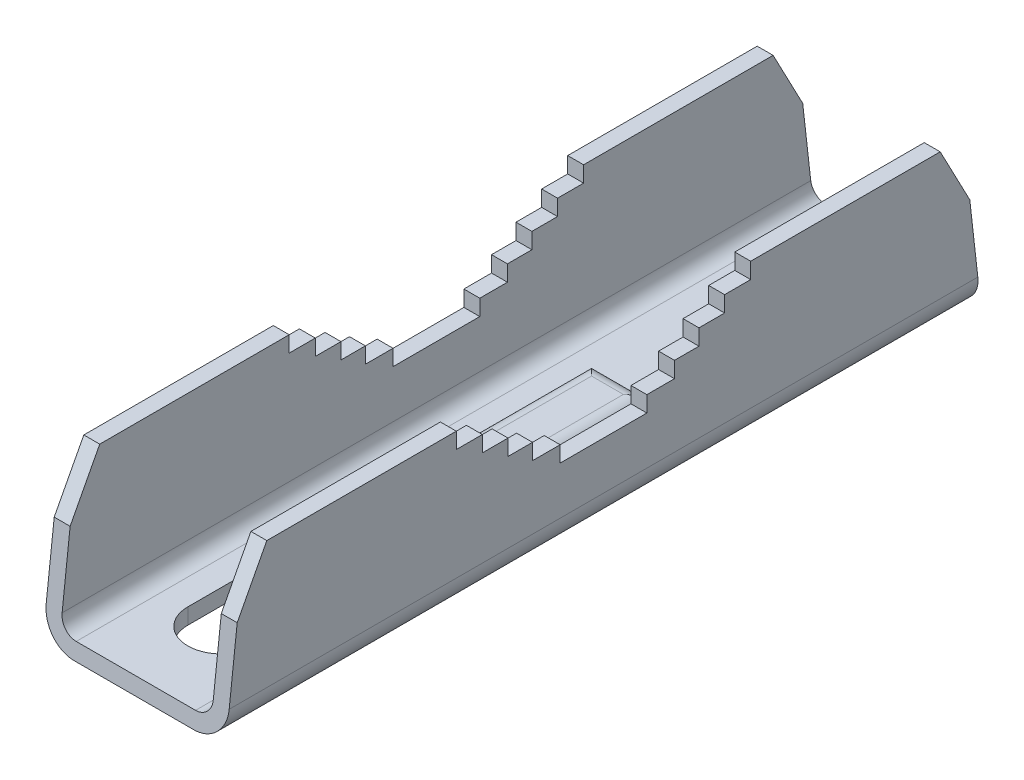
ISO-10303-21;
HEADER;
FILE_DESCRIPTION(('STEP AP214'),'2;1');
FILE_NAME('part.step','',(''),(''),'','','');
FILE_SCHEMA(('AUTOMOTIVE_DESIGN { 1 0 10303 214 1 1 1 1 }'));
ENDSEC;
DATA;
#1=APPLICATION_CONTEXT('core data for automotive mechanical design processes');
#2=APPLICATION_PROTOCOL_DEFINITION('international standard','automotive_design',2000,#1);
#3=PRODUCT_CONTEXT('',#1,'mechanical');
#4=PRODUCT('Part','Part','',(#3));
#5=PRODUCT_RELATED_PRODUCT_CATEGORY('part','',(#4));
#6=PRODUCT_DEFINITION_FORMATION('','',#4);
#7=PRODUCT_DEFINITION_CONTEXT('part definition',#1,'design');
#8=PRODUCT_DEFINITION('design','',#6,#7);
#9=PRODUCT_DEFINITION_SHAPE('','',#8);
#10=(LENGTH_UNIT() NAMED_UNIT(*) SI_UNIT(.MILLI.,.METRE.));
#11=(NAMED_UNIT(*) PLANE_ANGLE_UNIT() SI_UNIT($,.RADIAN.));
#12=(NAMED_UNIT(*) SI_UNIT($,.STERADIAN.) SOLID_ANGLE_UNIT());
#13=UNCERTAINTY_MEASURE_WITH_UNIT(LENGTH_MEASURE(1.E-05),#10,'distance_accuracy_value','');
#14=(GEOMETRIC_REPRESENTATION_CONTEXT(3) GLOBAL_UNCERTAINTY_ASSIGNED_CONTEXT((#13)) GLOBAL_UNIT_ASSIGNED_CONTEXT((#10,
#11,#12)) REPRESENTATION_CONTEXT('',''));
#15=CARTESIAN_POINT('',(0.,0.,0.));
#16=DIRECTION('',(0.,0.,1.));
#17=DIRECTION('',(1.,0.,0.));
#18=AXIS2_PLACEMENT_3D('',#15,#16,#17);
#19=CARTESIAN_POINT('',(-11.5,20.,-29.));
#20=DIRECTION('',(0.,1.,0.));
#21=DIRECTION('',(0.,0.,1.));
#22=AXIS2_PLACEMENT_3D('',#19,#20,#21);
#23=PLANE('',#22);
#24=DIRECTION('',(-1.,0.,0.));
#25=VECTOR('',#24,1.);
#26=CARTESIAN_POINT('',(-10.5,20.,-29.));
#27=LINE('',#26,#25);
#28=CARTESIAN_POINT('',(-9.5,20.,-29.0000000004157));
#29=VERTEX_POINT('',#28);
#30=CARTESIAN_POINT('',(-11.5,20.,-29.0000000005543));
#31=VERTEX_POINT('',#30);
#32=EDGE_CURVE('E465',#29,#31,#27,.T.);
#33=ORIENTED_EDGE('',*,*,#32,.T.);
#34=DIRECTION('',(0.,0.,-1.));
#35=VECTOR('',#34,1.);
#36=CARTESIAN_POINT('',(-11.5,20.,-47.5));
#37=LINE('',#36,#35);
#38=CARTESIAN_POINT('',(-11.5,20.,-5.17993301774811));
#39=VERTEX_POINT('',#38);
#40=EDGE_CURVE('E676',#39,#31,#37,.T.);
#41=ORIENTED_EDGE('',*,*,#40,.F.);
#42=DIRECTION('',(1.,0.,0.));
#43=VECTOR('',#42,1.);
#44=CARTESIAN_POINT('',(-10.5,20.,-5.179933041));
#45=LINE('',#44,#43);
#46=CARTESIAN_POINT('',(-9.5,20.,-5.179933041));
#47=VERTEX_POINT('',#46);
#48=EDGE_CURVE('E487',#39,#47,#45,.T.);
#49=ORIENTED_EDGE('',*,*,#48,.T.);
#50=DIRECTION('',(0.,0.,-1.));
#51=VECTOR('',#50,1.);
#52=CARTESIAN_POINT('',(-9.5,20.,-47.5));
#53=LINE('',#52,#51);
#54=EDGE_CURVE('E481',#47,#29,#53,.T.);
#55=ORIENTED_EDGE('',*,*,#54,.T.);
#56=EDGE_LOOP('',(#33,#41,#49,#55));
#57=FACE_BOUND('',#56,.T.);
#58=ADVANCED_FACE('F17',(#57),#23,.T.);
#59=CARTESIAN_POINT('',(-11.5,20.,-29.));
#60=DIRECTION('',(0.,0.,1.));
#61=DIRECTION('',(0.,-1.,0.));
#62=AXIS2_PLACEMENT_3D('',#59,#60,#61);
#63=PLANE('',#62);
#64=ORIENTED_EDGE('',*,*,#32,.F.);
#65=DIRECTION('',(0.,-1.,0.));
#66=VECTOR('',#65,1.);
#67=CARTESIAN_POINT('',(-9.5,12.,-29.0000000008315));
#68=LINE('',#67,#66);
#69=CARTESIAN_POINT('',(-9.5,18.,-29.0000000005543));
#70=VERTEX_POINT('',#69);
#71=EDGE_CURVE('E469',#29,#70,#68,.T.);
#72=ORIENTED_EDGE('',*,*,#71,.T.);
#73=DIRECTION('',(-1.,0.,0.));
#74=VECTOR('',#73,1.);
#75=CARTESIAN_POINT('',(-10.5,18.,-29.));
#76=LINE('',#75,#74);
#77=CARTESIAN_POINT('',(-11.5,18.,-29.0000000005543));
#78=VERTEX_POINT('',#77);
#79=EDGE_CURVE('E474',#70,#78,#76,.T.);
#80=ORIENTED_EDGE('',*,*,#79,.T.);
#81=DIRECTION('',(0.,-1.,0.));
#82=VECTOR('',#81,1.);
#83=CARTESIAN_POINT('',(-11.5,12.,-29.0000000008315));
#84=LINE('',#83,#82);
#85=EDGE_CURVE('E470',#31,#78,#84,.T.);
#86=ORIENTED_EDGE('',*,*,#85,.F.);
#87=EDGE_LOOP('',(#64,#72,#80,#86));
#88=FACE_BOUND('',#87,.T.);
#89=ADVANCED_FACE('F467',(#88),#63,.F.);
#90=CARTESIAN_POINT('',(-11.5,18.,-29.));
#91=DIRECTION('',(0.,-1.,0.));
#92=DIRECTION('',(0.,0.,-1.));
#93=AXIS2_PLACEMENT_3D('',#90,#91,#92);
#94=PLANE('',#93);
#95=ORIENTED_EDGE('',*,*,#79,.F.);
#96=DIRECTION('',(0.,0.,-1.));
#97=VECTOR('',#96,1.);
#98=CARTESIAN_POINT('',(-9.5,18.,-47.5));
#99=LINE('',#98,#97);
#100=CARTESIAN_POINT('',(-9.5,18.,-32.2749999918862));
#101=VERTEX_POINT('',#100);
#102=EDGE_CURVE('E485',#70,#101,#99,.T.);
#103=ORIENTED_EDGE('',*,*,#102,.T.);
#104=DIRECTION('',(-1.,0.,0.));
#105=VECTOR('',#104,1.);
#106=CARTESIAN_POINT('',(-10.5,18.,-32.275));
#107=LINE('',#106,#105);
#108=CARTESIAN_POINT('',(-11.5,18.,-32.2749999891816));
#109=VERTEX_POINT('',#108);
#110=EDGE_CURVE('E849',#101,#109,#107,.T.);
#111=ORIENTED_EDGE('',*,*,#110,.T.);
#112=DIRECTION('',(0.,0.,-1.));
#113=VECTOR('',#112,1.);
#114=CARTESIAN_POINT('',(-11.5,18.,-47.5));
#115=LINE('',#114,#113);
#116=EDGE_CURVE('E853',#78,#109,#115,.T.);
#117=ORIENTED_EDGE('',*,*,#116,.F.);
#118=EDGE_LOOP('',(#95,#103,#111,#117));
#119=FACE_BOUND('',#118,.T.);
#120=ADVANCED_FACE('F966',(#119),#94,.F.);
#121=CARTESIAN_POINT('',(-11.5,16.,-32.275));
#122=DIRECTION('',(0.,0.,1.));
#123=DIRECTION('',(1.,0.,0.));
#124=AXIS2_PLACEMENT_3D('',#121,#122,#123);
#125=PLANE('',#124);
#126=ORIENTED_EDGE('',*,*,#110,.F.);
#127=DIRECTION('',(0.,-1.,0.));
#128=VECTOR('',#127,1.);
#129=CARTESIAN_POINT('',(-9.5,12.,-32.2749999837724));
#130=LINE('',#129,#128);
#131=CARTESIAN_POINT('',(-9.5,16.,-32.2749999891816));
#132=VERTEX_POINT('',#131);
#133=EDGE_CURVE('E956',#101,#132,#130,.T.);
#134=ORIENTED_EDGE('',*,*,#133,.T.);
#135=DIRECTION('',(-1.,0.,0.));
#136=VECTOR('',#135,1.);
#137=CARTESIAN_POINT('',(-10.5,16.,-32.275));
#138=LINE('',#137,#136);
#139=CARTESIAN_POINT('',(-11.5,16.,-32.2749999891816));
#140=VERTEX_POINT('',#139);
#141=EDGE_CURVE('E840',#132,#140,#138,.T.);
#142=ORIENTED_EDGE('',*,*,#141,.T.);
#143=DIRECTION('',(0.,-1.,0.));
#144=VECTOR('',#143,1.);
#145=CARTESIAN_POINT('',(-11.5,12.,-32.2749999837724));
#146=LINE('',#145,#144);
#147=EDGE_CURVE('E844',#109,#140,#146,.T.);
#148=ORIENTED_EDGE('',*,*,#147,.F.);
#149=EDGE_LOOP('',(#126,#134,#142,#148));
#150=FACE_BOUND('',#149,.T.);
#151=ADVANCED_FACE('F972',(#150),#125,.F.);
#152=CARTESIAN_POINT('',(-11.5,16.,-32.275));
#153=DIRECTION('',(0.,-1.,0.));
#154=DIRECTION('',(0.,0.,-1.));
#155=AXIS2_PLACEMENT_3D('',#152,#153,#154);
#156=PLANE('',#155);
#157=ORIENTED_EDGE('',*,*,#141,.F.);
#158=DIRECTION('',(0.,0.,-1.));
#159=VECTOR('',#158,1.);
#160=CARTESIAN_POINT('',(-9.5,16.,-47.5));
#161=LINE('',#160,#159);
#162=CARTESIAN_POINT('',(-9.5,16.,-35.4999999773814));
#163=VERTEX_POINT('',#162);
#164=EDGE_CURVE('E951',#132,#163,#161,.T.);
#165=ORIENTED_EDGE('',*,*,#164,.T.);
#166=DIRECTION('',(-1.,0.,0.));
#167=VECTOR('',#166,1.);
#168=CARTESIAN_POINT('',(-10.5,16.,-35.5));
#169=LINE('',#168,#167);
#170=CARTESIAN_POINT('',(-11.5,16.,-35.4999999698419));
#171=VERTEX_POINT('',#170);
#172=EDGE_CURVE('E831',#163,#171,#169,.T.);
#173=ORIENTED_EDGE('',*,*,#172,.T.);
#174=DIRECTION('',(0.,0.,-1.));
#175=VECTOR('',#174,1.);
#176=CARTESIAN_POINT('',(-11.5,16.,-47.5));
#177=LINE('',#176,#175);
#178=EDGE_CURVE('E835',#140,#171,#177,.T.);
#179=ORIENTED_EDGE('',*,*,#178,.F.);
#180=EDGE_LOOP('',(#157,#165,#173,#179));
#181=FACE_BOUND('',#180,.T.);
#182=ADVANCED_FACE('F975',(#181),#156,.F.);
#183=CARTESIAN_POINT('',(-11.5,14.,-35.5));
#184=DIRECTION('',(0.,0.,1.));
#185=DIRECTION('',(1.,0.,0.));
#186=AXIS2_PLACEMENT_3D('',#183,#184,#185);
#187=PLANE('',#186);
#188=ORIENTED_EDGE('',*,*,#172,.F.);
#189=DIRECTION('',(0.,-1.,0.));
#190=VECTOR('',#189,1.);
#191=CARTESIAN_POINT('',(-9.5,12.,-35.4999999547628));
#192=LINE('',#191,#190);
#193=CARTESIAN_POINT('',(-9.5,14.,-35.4999999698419));
#194=VERTEX_POINT('',#193);
#195=EDGE_CURVE('E946',#163,#194,#192,.T.);
#196=ORIENTED_EDGE('',*,*,#195,.T.);
#197=DIRECTION('',(-1.,0.,0.));
#198=VECTOR('',#197,1.);
#199=CARTESIAN_POINT('',(-10.5,14.,-35.5));
#200=LINE('',#199,#198);
#201=CARTESIAN_POINT('',(-11.5,14.,-35.4999999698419));
#202=VERTEX_POINT('',#201);
#203=EDGE_CURVE('E822',#194,#202,#200,.T.);
#204=ORIENTED_EDGE('',*,*,#203,.T.);
#205=DIRECTION('',(0.,-1.,0.));
#206=VECTOR('',#205,1.);
#207=CARTESIAN_POINT('',(-11.5,12.,-35.4999999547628));
#208=LINE('',#207,#206);
#209=EDGE_CURVE('E826',#171,#202,#208,.T.);
#210=ORIENTED_EDGE('',*,*,#209,.F.);
#211=EDGE_LOOP('',(#188,#196,#204,#210));
#212=FACE_BOUND('',#211,.T.);
#213=ADVANCED_FACE('F979',(#212),#187,.F.);
#214=CARTESIAN_POINT('',(-11.5,14.,-35.5));
#215=DIRECTION('',(0.,-1.,0.));
#216=DIRECTION('',(0.,0.,-1.));
#217=AXIS2_PLACEMENT_3D('',#214,#215,#216);
#218=PLANE('',#217);
#219=ORIENTED_EDGE('',*,*,#203,.F.);
#220=DIRECTION('',(0.,0.,-1.));
#221=VECTOR('',#220,1.);
#222=CARTESIAN_POINT('',(-9.5,14.,-47.5));
#223=LINE('',#222,#221);
#224=CARTESIAN_POINT('',(-9.5,14.,-38.5749999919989));
#225=VERTEX_POINT('',#224);
#226=EDGE_CURVE('E941',#194,#225,#223,.T.);
#227=ORIENTED_EDGE('',*,*,#226,.T.);
#228=DIRECTION('',(-1.,0.,0.));
#229=VECTOR('',#228,1.);
#230=CARTESIAN_POINT('',(-10.5,14.,-38.575));
#231=LINE('',#230,#229);
#232=CARTESIAN_POINT('',(-11.5,14.,-38.5749999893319));
#233=VERTEX_POINT('',#232);
#234=EDGE_CURVE('E813',#225,#233,#231,.T.);
#235=ORIENTED_EDGE('',*,*,#234,.T.);
#236=DIRECTION('',(0.,0.,-1.));
#237=VECTOR('',#236,1.);
#238=CARTESIAN_POINT('',(-11.5,14.,-47.5));
#239=LINE('',#238,#237);
#240=EDGE_CURVE('E817',#202,#233,#239,.T.);
#241=ORIENTED_EDGE('',*,*,#240,.F.);
#242=EDGE_LOOP('',(#219,#227,#235,#241));
#243=FACE_BOUND('',#242,.T.);
#244=ADVANCED_FACE('F983',(#243),#218,.F.);
#245=CARTESIAN_POINT('',(-11.5,12.,-38.575));
#246=DIRECTION('',(0.,0.,1.));
#247=DIRECTION('',(1.,0.,0.));
#248=AXIS2_PLACEMENT_3D('',#245,#246,#247);
#249=PLANE('',#248);
#250=ORIENTED_EDGE('',*,*,#234,.F.);
#251=DIRECTION('',(0.,-1.,0.));
#252=VECTOR('',#251,1.);
#253=CARTESIAN_POINT('',(-9.5,12.,-38.5749999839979));
#254=LINE('',#253,#252);
#255=CARTESIAN_POINT('',(-9.5,12.,-38.5749999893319));
#256=VERTEX_POINT('',#255);
#257=EDGE_CURVE('E936',#225,#256,#254,.T.);
#258=ORIENTED_EDGE('',*,*,#257,.T.);
#259=DIRECTION('',(-1.,0.,0.));
#260=VECTOR('',#259,1.);
#261=CARTESIAN_POINT('',(-10.5,12.,-38.575));
#262=LINE('',#261,#260);
#263=CARTESIAN_POINT('',(-11.5,12.,-38.5749999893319));
#264=VERTEX_POINT('',#263);
#265=EDGE_CURVE('E804',#256,#264,#262,.T.);
#266=ORIENTED_EDGE('',*,*,#265,.T.);
#267=DIRECTION('',(0.,-1.,0.));
#268=VECTOR('',#267,1.);
#269=CARTESIAN_POINT('',(-11.5,12.,-38.5749999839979));
#270=LINE('',#269,#268);
#271=EDGE_CURVE('E808',#233,#264,#270,.T.);
#272=ORIENTED_EDGE('',*,*,#271,.F.);
#273=EDGE_LOOP('',(#250,#258,#266,#272));
#274=FACE_BOUND('',#273,.T.);
#275=ADVANCED_FACE('F987',(#274),#249,.F.);
#276=CARTESIAN_POINT('',(-11.5,12.,-38.575));
#277=DIRECTION('',(0.,-1.,0.));
#278=DIRECTION('',(0.,0.,-1.));
#279=AXIS2_PLACEMENT_3D('',#276,#277,#278);
#280=PLANE('',#279);
#281=ORIENTED_EDGE('',*,*,#265,.F.);
#282=DIRECTION('',(0.,0.,-1.));
#283=VECTOR('',#282,1.);
#284=CARTESIAN_POINT('',(-9.5,12.,-47.5));
#285=LINE('',#284,#283);
#286=CARTESIAN_POINT('',(-9.5,12.,-42.0500000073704));
#287=VERTEX_POINT('',#286);
#288=EDGE_CURVE('E931',#256,#287,#285,.T.);
#289=ORIENTED_EDGE('',*,*,#288,.T.);
#290=DIRECTION('',(-1.,0.,0.));
#291=VECTOR('',#290,1.);
#292=CARTESIAN_POINT('',(-10.5,12.,-42.05));
#293=LINE('',#292,#291);
#294=CARTESIAN_POINT('',(-11.5,12.,-42.0500000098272));
#295=VERTEX_POINT('',#294);
#296=EDGE_CURVE('E795',#287,#295,#293,.T.);
#297=ORIENTED_EDGE('',*,*,#296,.T.);
#298=DIRECTION('',(0.,0.,-1.));
#299=VECTOR('',#298,1.);
#300=CARTESIAN_POINT('',(-11.5,12.,-47.5));
#301=LINE('',#300,#299);
#302=EDGE_CURVE('E799',#264,#295,#301,.T.);
#303=ORIENTED_EDGE('',*,*,#302,.F.);
#304=EDGE_LOOP('',(#281,#289,#297,#303));
#305=FACE_BOUND('',#304,.T.);
#306=ADVANCED_FACE('F991',(#305),#280,.F.);
#307=CARTESIAN_POINT('',(-11.5,10.,-42.05));
#308=DIRECTION('',(0.,0.,1.));
#309=DIRECTION('',(1.,0.,0.));
#310=AXIS2_PLACEMENT_3D('',#307,#308,#309);
#311=PLANE('',#310);
#312=ORIENTED_EDGE('',*,*,#296,.F.);
#313=DIRECTION('',(0.,-1.,0.));
#314=VECTOR('',#313,1.);
#315=CARTESIAN_POINT('',(-9.5,12.,-42.0500000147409));
#316=LINE('',#315,#314);
#317=CARTESIAN_POINT('',(-9.5,10.,-42.0500000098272));
#318=VERTEX_POINT('',#317);
#319=EDGE_CURVE('E926',#287,#318,#316,.T.);
#320=ORIENTED_EDGE('',*,*,#319,.T.);
#321=DIRECTION('',(-1.,0.,0.));
#322=VECTOR('',#321,1.);
#323=CARTESIAN_POINT('',(-10.5,10.,-42.05));
#324=LINE('',#323,#322);
#325=CARTESIAN_POINT('',(-11.5,10.,-42.0500000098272));
#326=VERTEX_POINT('',#325);
#327=EDGE_CURVE('E786',#318,#326,#324,.T.);
#328=ORIENTED_EDGE('',*,*,#327,.T.);
#329=DIRECTION('',(0.,-1.,0.));
#330=VECTOR('',#329,1.);
#331=CARTESIAN_POINT('',(-11.5,12.,-42.0500000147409));
#332=LINE('',#331,#330);
#333=EDGE_CURVE('E790',#295,#326,#332,.T.);
#334=ORIENTED_EDGE('',*,*,#333,.F.);
#335=EDGE_LOOP('',(#312,#320,#328,#334));
#336=FACE_BOUND('',#335,.T.);
#337=ADVANCED_FACE('F995',(#336),#311,.F.);
#338=CARTESIAN_POINT('',(-11.5,10.,-42.05));
#339=DIRECTION('',(0.,-1.,0.));
#340=DIRECTION('',(0.,0.,-1.));
#341=AXIS2_PLACEMENT_3D('',#338,#339,#340);
#342=PLANE('',#341);
#343=ORIENTED_EDGE('',*,*,#327,.F.);
#344=DIRECTION('',(0.,0.,-1.));
#345=VECTOR('',#344,1.);
#346=CARTESIAN_POINT('',(-9.5,10.,-47.5));
#347=LINE('',#346,#345);
#348=CARTESIAN_POINT('',(-9.5,10.,-52.9499999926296));
#349=VERTEX_POINT('',#348);
#350=EDGE_CURVE('E921',#318,#349,#347,.T.);
#351=ORIENTED_EDGE('',*,*,#350,.T.);
#352=DIRECTION('',(-1.,0.,0.));
#353=VECTOR('',#352,1.);
#354=CARTESIAN_POINT('',(-10.5,10.,-52.95));
#355=LINE('',#354,#353);
#356=CARTESIAN_POINT('',(-11.5,10.,-52.9499999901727));
#357=VERTEX_POINT('',#356);
#358=EDGE_CURVE('E777',#349,#357,#355,.T.);
#359=ORIENTED_EDGE('',*,*,#358,.T.);
#360=DIRECTION('',(0.,0.,-1.));
#361=VECTOR('',#360,1.);
#362=CARTESIAN_POINT('',(-11.5,10.,-47.5));
#363=LINE('',#362,#361);
#364=EDGE_CURVE('E781',#326,#357,#363,.T.);
#365=ORIENTED_EDGE('',*,*,#364,.F.);
#366=EDGE_LOOP('',(#343,#351,#359,#365));
#367=FACE_BOUND('',#366,.T.);
#368=ADVANCED_FACE('F999',(#367),#342,.F.);
#369=CARTESIAN_POINT('',(-9.5,10.,-52.95));
#370=DIRECTION('',(0.,0.,-1.));
#371=DIRECTION('',(-1.,0.,0.));
#372=AXIS2_PLACEMENT_3D('',#369,#370,#371);
#373=PLANE('',#372);
#374=ORIENTED_EDGE('',*,*,#358,.F.);
#375=DIRECTION('',(0.,1.,0.));
#376=VECTOR('',#375,1.);
#377=CARTESIAN_POINT('',(-9.5,12.,-52.9499999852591));
#378=LINE('',#377,#376);
#379=CARTESIAN_POINT('',(-9.5,12.,-52.9499999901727));
#380=VERTEX_POINT('',#379);
#381=EDGE_CURVE('E916',#349,#380,#378,.T.);
#382=ORIENTED_EDGE('',*,*,#381,.T.);
#383=DIRECTION('',(-1.,0.,0.));
#384=VECTOR('',#383,1.);
#385=CARTESIAN_POINT('',(-10.5,12.,-52.95));
#386=LINE('',#385,#384);
#387=CARTESIAN_POINT('',(-11.5,12.,-52.9499999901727));
#388=VERTEX_POINT('',#387);
#389=EDGE_CURVE('E768',#380,#388,#386,.T.);
#390=ORIENTED_EDGE('',*,*,#389,.T.);
#391=DIRECTION('',(0.,1.,0.));
#392=VECTOR('',#391,1.);
#393=CARTESIAN_POINT('',(-11.5,12.,-52.9499999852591));
#394=LINE('',#393,#392);
#395=EDGE_CURVE('E772',#357,#388,#394,.T.);
#396=ORIENTED_EDGE('',*,*,#395,.F.);
#397=EDGE_LOOP('',(#374,#382,#390,#396));
#398=FACE_BOUND('',#397,.T.);
#399=ADVANCED_FACE('F1003',(#398),#373,.F.);
#400=CARTESIAN_POINT('',(-11.5,12.,-52.95));
#401=DIRECTION('',(0.,-1.,0.));
#402=DIRECTION('',(0.,0.,-1.));
#403=AXIS2_PLACEMENT_3D('',#400,#401,#402);
#404=PLANE('',#403);
#405=ORIENTED_EDGE('',*,*,#389,.F.);
#406=DIRECTION('',(0.,0.,-1.));
#407=VECTOR('',#406,1.);
#408=CARTESIAN_POINT('',(-9.5,12.,-47.5));
#409=LINE('',#408,#407);
#410=CARTESIAN_POINT('',(-9.5,12.,-56.4250000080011));
#411=VERTEX_POINT('',#410);
#412=EDGE_CURVE('E911',#380,#411,#409,.T.);
#413=ORIENTED_EDGE('',*,*,#412,.T.);
#414=DIRECTION('',(-1.,0.,0.));
#415=VECTOR('',#414,1.);
#416=CARTESIAN_POINT('',(-10.5,12.,-56.425));
#417=LINE('',#416,#415);
#418=CARTESIAN_POINT('',(-11.5,12.,-56.4250000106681));
#419=VERTEX_POINT('',#418);
#420=EDGE_CURVE('E759',#411,#419,#417,.T.);
#421=ORIENTED_EDGE('',*,*,#420,.T.);
#422=DIRECTION('',(0.,0.,-1.));
#423=VECTOR('',#422,1.);
#424=CARTESIAN_POINT('',(-11.5,12.,-47.5));
#425=LINE('',#424,#423);
#426=EDGE_CURVE('E763',#388,#419,#425,.T.);
#427=ORIENTED_EDGE('',*,*,#426,.F.);
#428=EDGE_LOOP('',(#405,#413,#421,#427));
#429=FACE_BOUND('',#428,.T.);
#430=ADVANCED_FACE('F1007',(#429),#404,.F.);
#431=CARTESIAN_POINT('',(-9.5,12.,-56.425));
#432=DIRECTION('',(0.,0.,-1.));
#433=DIRECTION('',(-1.,0.,0.));
#434=AXIS2_PLACEMENT_3D('',#431,#432,#433);
#435=PLANE('',#434);
#436=ORIENTED_EDGE('',*,*,#420,.F.);
#437=DIRECTION('',(0.,1.,0.));
#438=VECTOR('',#437,1.);
#439=CARTESIAN_POINT('',(-9.5,12.,-56.4250000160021));
#440=LINE('',#439,#438);
#441=CARTESIAN_POINT('',(-9.5,14.,-56.4250000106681));
#442=VERTEX_POINT('',#441);
#443=EDGE_CURVE('E906',#411,#442,#440,.T.);
#444=ORIENTED_EDGE('',*,*,#443,.T.);
#445=DIRECTION('',(-1.,0.,0.));
#446=VECTOR('',#445,1.);
#447=CARTESIAN_POINT('',(-10.5,14.,-56.425));
#448=LINE('',#447,#446);
#449=CARTESIAN_POINT('',(-11.5,14.,-56.4250000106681));
#450=VERTEX_POINT('',#449);
#451=EDGE_CURVE('E750',#442,#450,#448,.T.);
#452=ORIENTED_EDGE('',*,*,#451,.T.);
#453=DIRECTION('',(0.,1.,0.));
#454=VECTOR('',#453,1.);
#455=CARTESIAN_POINT('',(-11.5,12.,-56.4250000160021));
#456=LINE('',#455,#454);
#457=EDGE_CURVE('E754',#419,#450,#456,.T.);
#458=ORIENTED_EDGE('',*,*,#457,.F.);
#459=EDGE_LOOP('',(#436,#444,#452,#458));
#460=FACE_BOUND('',#459,.T.);
#461=ADVANCED_FACE('F1011',(#460),#435,.F.);
#462=CARTESIAN_POINT('',(-11.5,14.,-56.425));
#463=DIRECTION('',(0.,-1.,0.));
#464=DIRECTION('',(0.,0.,-1.));
#465=AXIS2_PLACEMENT_3D('',#462,#463,#464);
#466=PLANE('',#465);
#467=ORIENTED_EDGE('',*,*,#451,.F.);
#468=DIRECTION('',(0.,0.,-1.));
#469=VECTOR('',#468,1.);
#470=CARTESIAN_POINT('',(-9.5,14.,-47.5));
#471=LINE('',#470,#469);
#472=CARTESIAN_POINT('',(-9.5,14.,-59.5000000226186));
#473=VERTEX_POINT('',#472);
#474=EDGE_CURVE('E901',#442,#473,#471,.T.);
#475=ORIENTED_EDGE('',*,*,#474,.T.);
#476=DIRECTION('',(-1.,0.,0.));
#477=VECTOR('',#476,1.);
#478=CARTESIAN_POINT('',(-10.5,14.,-59.5));
#479=LINE('',#478,#477);
#480=CARTESIAN_POINT('',(-11.5,14.,-59.5000000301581));
#481=VERTEX_POINT('',#480);
#482=EDGE_CURVE('E741',#473,#481,#479,.T.);
#483=ORIENTED_EDGE('',*,*,#482,.T.);
#484=DIRECTION('',(0.,0.,-1.));
#485=VECTOR('',#484,1.);
#486=CARTESIAN_POINT('',(-11.5,14.,-47.5));
#487=LINE('',#486,#485);
#488=EDGE_CURVE('E745',#450,#481,#487,.T.);
#489=ORIENTED_EDGE('',*,*,#488,.F.);
#490=EDGE_LOOP('',(#467,#475,#483,#489));
#491=FACE_BOUND('',#490,.T.);
#492=ADVANCED_FACE('F1015',(#491),#466,.F.);
#493=CARTESIAN_POINT('',(-9.5,14.,-59.5));
#494=DIRECTION('',(0.,0.,-1.));
#495=DIRECTION('',(-1.,0.,0.));
#496=AXIS2_PLACEMENT_3D('',#493,#494,#495);
#497=PLANE('',#496);
#498=ORIENTED_EDGE('',*,*,#482,.F.);
#499=DIRECTION('',(0.,1.,0.));
#500=VECTOR('',#499,1.);
#501=CARTESIAN_POINT('',(-9.5,12.,-59.5000000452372));
#502=LINE('',#501,#500);
#503=CARTESIAN_POINT('',(-9.5,16.,-59.5000000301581));
#504=VERTEX_POINT('',#503);
#505=EDGE_CURVE('E896',#473,#504,#502,.T.);
#506=ORIENTED_EDGE('',*,*,#505,.T.);
#507=DIRECTION('',(-1.,0.,0.));
#508=VECTOR('',#507,1.);
#509=CARTESIAN_POINT('',(-10.5,16.,-59.5));
#510=LINE('',#509,#508);
#511=CARTESIAN_POINT('',(-11.5,16.,-59.5000000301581));
#512=VERTEX_POINT('',#511);
#513=EDGE_CURVE('E732',#504,#512,#510,.T.);
#514=ORIENTED_EDGE('',*,*,#513,.T.);
#515=DIRECTION('',(0.,1.,0.));
#516=VECTOR('',#515,1.);
#517=CARTESIAN_POINT('',(-11.5,12.,-59.5000000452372));
#518=LINE('',#517,#516);
#519=EDGE_CURVE('E736',#481,#512,#518,.T.);
#520=ORIENTED_EDGE('',*,*,#519,.F.);
#521=EDGE_LOOP('',(#498,#506,#514,#520));
#522=FACE_BOUND('',#521,.T.);
#523=ADVANCED_FACE('F1019',(#522),#497,.F.);
#524=CARTESIAN_POINT('',(-11.5,16.,-59.5));
#525=DIRECTION('',(0.,-1.,0.));
#526=DIRECTION('',(0.,0.,-1.));
#527=AXIS2_PLACEMENT_3D('',#524,#525,#526);
#528=PLANE('',#527);
#529=ORIENTED_EDGE('',*,*,#513,.F.);
#530=DIRECTION('',(0.,0.,-1.));
#531=VECTOR('',#530,1.);
#532=CARTESIAN_POINT('',(-9.5,16.,-47.5));
#533=LINE('',#532,#531);
#534=CARTESIAN_POINT('',(-9.5,16.,-62.7250000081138));
#535=VERTEX_POINT('',#534);
#536=EDGE_CURVE('E891',#504,#535,#533,.T.);
#537=ORIENTED_EDGE('',*,*,#536,.T.);
#538=DIRECTION('',(-1.,0.,0.));
#539=VECTOR('',#538,1.);
#540=CARTESIAN_POINT('',(-10.5,16.,-62.725));
#541=LINE('',#540,#539);
#542=CARTESIAN_POINT('',(-11.5,16.,-62.7250000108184));
#543=VERTEX_POINT('',#542);
#544=EDGE_CURVE('E723',#535,#543,#541,.T.);
#545=ORIENTED_EDGE('',*,*,#544,.T.);
#546=DIRECTION('',(0.,0.,-1.));
#547=VECTOR('',#546,1.);
#548=CARTESIAN_POINT('',(-11.5,16.,-47.5));
#549=LINE('',#548,#547);
#550=EDGE_CURVE('E727',#512,#543,#549,.T.);
#551=ORIENTED_EDGE('',*,*,#550,.F.);
#552=EDGE_LOOP('',(#529,#537,#545,#551));
#553=FACE_BOUND('',#552,.T.);
#554=ADVANCED_FACE('F1023',(#553),#528,.F.);
#555=CARTESIAN_POINT('',(-9.5,16.,-62.725));
#556=DIRECTION('',(0.,0.,-1.));
#557=DIRECTION('',(-1.,0.,0.));
#558=AXIS2_PLACEMENT_3D('',#555,#556,#557);
#559=PLANE('',#558);
#560=ORIENTED_EDGE('',*,*,#544,.F.);
#561=DIRECTION('',(0.,1.,0.));
#562=VECTOR('',#561,1.);
#563=CARTESIAN_POINT('',(-9.5,12.,-62.7250000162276));
#564=LINE('',#563,#562);
#565=CARTESIAN_POINT('',(-9.5,18.,-62.7250000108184));
#566=VERTEX_POINT('',#565);
#567=EDGE_CURVE('E886',#535,#566,#564,.T.);
#568=ORIENTED_EDGE('',*,*,#567,.T.);
#569=DIRECTION('',(-1.,0.,0.));
#570=VECTOR('',#569,1.);
#571=CARTESIAN_POINT('',(-10.5,18.,-62.725));
#572=LINE('',#571,#570);
#573=CARTESIAN_POINT('',(-11.5,18.,-62.7250000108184));
#574=VERTEX_POINT('',#573);
#575=EDGE_CURVE('E714',#566,#574,#572,.T.);
#576=ORIENTED_EDGE('',*,*,#575,.T.);
#577=DIRECTION('',(0.,1.,0.));
#578=VECTOR('',#577,1.);
#579=CARTESIAN_POINT('',(-11.5,12.,-62.7250000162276));
#580=LINE('',#579,#578);
#581=EDGE_CURVE('E718',#543,#574,#580,.T.);
#582=ORIENTED_EDGE('',*,*,#581,.F.);
#583=EDGE_LOOP('',(#560,#568,#576,#582));
#584=FACE_BOUND('',#583,.T.);
#585=ADVANCED_FACE('F1027',(#584),#559,.F.);
#586=CARTESIAN_POINT('',(-11.5,18.,-62.725));
#587=DIRECTION('',(0.,-1.,0.));
#588=DIRECTION('',(0.,0.,-1.));
#589=AXIS2_PLACEMENT_3D('',#586,#587,#588);
#590=PLANE('',#589);
#591=ORIENTED_EDGE('',*,*,#575,.F.);
#592=DIRECTION('',(0.,0.,-1.));
#593=VECTOR('',#592,1.);
#594=CARTESIAN_POINT('',(-9.5,18.,-47.5));
#595=LINE('',#594,#593);
#596=CARTESIAN_POINT('',(-9.5,18.,-65.9999999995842));
#597=VERTEX_POINT('',#596);
#598=EDGE_CURVE('E881',#566,#597,#595,.T.);
#599=ORIENTED_EDGE('',*,*,#598,.T.);
#600=DIRECTION('',(-1.,0.,0.));
#601=VECTOR('',#600,1.);
#602=CARTESIAN_POINT('',(-10.5,18.,-66.));
#603=LINE('',#602,#601);
#604=CARTESIAN_POINT('',(-11.5,18.,-65.9999999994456));
#605=VERTEX_POINT('',#604);
#606=EDGE_CURVE('E705',#597,#605,#603,.T.);
#607=ORIENTED_EDGE('',*,*,#606,.T.);
#608=DIRECTION('',(0.,0.,-1.));
#609=VECTOR('',#608,1.);
#610=CARTESIAN_POINT('',(-11.5,18.,-47.5));
#611=LINE('',#610,#609);
#612=EDGE_CURVE('E709',#574,#605,#611,.T.);
#613=ORIENTED_EDGE('',*,*,#612,.F.);
#614=EDGE_LOOP('',(#591,#599,#607,#613));
#615=FACE_BOUND('',#614,.T.);
#616=ADVANCED_FACE('F1032',(#615),#590,.F.);
#617=CARTESIAN_POINT('',(-9.5,18.,-66.));
#618=DIRECTION('',(0.,0.,-1.));
#619=DIRECTION('',(-1.,0.,0.));
#620=AXIS2_PLACEMENT_3D('',#617,#618,#619);
#621=PLANE('',#620);
#622=ORIENTED_EDGE('',*,*,#606,.F.);
#623=DIRECTION('',(0.,1.,0.));
#624=VECTOR('',#623,1.);
#625=CARTESIAN_POINT('',(-9.5,12.,-65.9999999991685));
#626=LINE('',#625,#624);
#627=CARTESIAN_POINT('',(-9.5,20.,-65.9999999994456));
#628=VERTEX_POINT('',#627);
#629=EDGE_CURVE('E876',#597,#628,#626,.T.);
#630=ORIENTED_EDGE('',*,*,#629,.T.);
#631=DIRECTION('',(1.,0.,0.));
#632=VECTOR('',#631,1.);
#633=CARTESIAN_POINT('',(-10.5,20.,-66.));
#634=LINE('',#633,#632);
#635=CARTESIAN_POINT('',(-11.5,20.,-65.9999999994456));
#636=VERTEX_POINT('',#635);
#637=EDGE_CURVE('E702',#636,#628,#634,.T.);
#638=ORIENTED_EDGE('',*,*,#637,.F.);
#639=DIRECTION('',(0.,1.,0.));
#640=VECTOR('',#639,1.);
#641=CARTESIAN_POINT('',(-11.5,12.,-65.9999999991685));
#642=LINE('',#641,#640);
#643=EDGE_CURVE('E699',#605,#636,#642,.T.);
#644=ORIENTED_EDGE('',*,*,#643,.F.);
#645=EDGE_LOOP('',(#622,#630,#638,#644));
#646=FACE_BOUND('',#645,.T.);
#647=ADVANCED_FACE('F1036',(#646),#621,.F.);
#648=CARTESIAN_POINT('',(-11.5,20.,-89.820066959));
#649=DIRECTION('',(0.,1.,0.));
#650=DIRECTION('',(0.,0.,1.));
#651=AXIS2_PLACEMENT_3D('',#648,#649,#650);
#652=PLANE('',#651);
#653=ORIENTED_EDGE('',*,*,#637,.T.);
#654=DIRECTION('',(0.,0.,-1.));
#655=VECTOR('',#654,1.);
#656=CARTESIAN_POINT('',(-9.5,20.,-47.5));
#657=LINE('',#656,#655);
#658=CARTESIAN_POINT('',(-9.5,20.,-89.8200669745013));
#659=VERTEX_POINT('',#658);
#660=EDGE_CURVE('E690',#628,#659,#657,.T.);
#661=ORIENTED_EDGE('',*,*,#660,.T.);
#662=DIRECTION('',(-1.,0.,0.));
#663=VECTOR('',#662,1.);
#664=CARTESIAN_POINT('',(-10.5,20.,-89.820066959));
#665=LINE('',#664,#663);
#666=CARTESIAN_POINT('',(-11.5,20.,-89.8200669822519));
#667=VERTEX_POINT('',#666);
#668=EDGE_CURVE('E677',#659,#667,#665,.T.);
#669=ORIENTED_EDGE('',*,*,#668,.T.);
#670=DIRECTION('',(0.,0.,-1.));
#671=VECTOR('',#670,1.);
#672=CARTESIAN_POINT('',(-11.5,20.,-47.5));
#673=LINE('',#672,#671);
#674=EDGE_CURVE('E673',#636,#667,#673,.T.);
#675=ORIENTED_EDGE('',*,*,#674,.F.);
#676=EDGE_LOOP('',(#653,#661,#669,#675));
#677=FACE_BOUND('',#676,.T.);
#678=ADVANCED_FACE('F1038',(#677),#652,.T.);
#679=CARTESIAN_POINT('',(9.5,20.,-89.820066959));
#680=DIRECTION('',(0.,1.,0.));
#681=DIRECTION('',(0.,0.,1.));
#682=AXIS2_PLACEMENT_3D('',#679,#680,#681);
#683=PLANE('',#682);
#684=DIRECTION('',(1.,0.,0.));
#685=VECTOR('',#684,1.);
#686=CARTESIAN_POINT('',(10.5,20.,-66.));
#687=LINE('',#686,#685);
#688=CARTESIAN_POINT('',(9.5,20.,-65.9999999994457));
#689=VERTEX_POINT('',#688);
#690=CARTESIAN_POINT('',(11.5,20.,-65.9999999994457));
#691=VERTEX_POINT('',#690);
#692=EDGE_CURVE('E704',#689,#691,#687,.T.);
#693=ORIENTED_EDGE('',*,*,#692,.T.);
#694=DIRECTION('',(0.,0.,1.));
#695=VECTOR('',#694,1.);
#696=CARTESIAN_POINT('',(11.5,20.,-47.5));
#697=LINE('',#696,#695);
#698=CARTESIAN_POINT('',(11.5,20.,-89.8200669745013));
#699=VERTEX_POINT('',#698);
#700=EDGE_CURVE('E496',#699,#691,#697,.T.);
#701=ORIENTED_EDGE('',*,*,#700,.F.);
#702=DIRECTION('',(-1.,0.,0.));
#703=VECTOR('',#702,1.);
#704=CARTESIAN_POINT('',(10.5,20.,-89.820066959));
#705=LINE('',#704,#703);
#706=CARTESIAN_POINT('',(9.5,20.,-89.820066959));
#707=VERTEX_POINT('',#706);
#708=EDGE_CURVE('E490',#699,#707,#705,.T.);
#709=ORIENTED_EDGE('',*,*,#708,.T.);
#710=DIRECTION('',(0.,0.,1.));
#711=VECTOR('',#710,1.);
#712=CARTESIAN_POINT('',(9.5,20.,-47.5));
#713=LINE('',#712,#711);
#714=EDGE_CURVE('E672',#707,#689,#713,.T.);
#715=ORIENTED_EDGE('',*,*,#714,.T.);
#716=EDGE_LOOP('',(#693,#701,#709,#715));
#717=FACE_BOUND('',#716,.T.);
#718=ADVANCED_FACE('F1285',(#717),#683,.T.);
#719=CARTESIAN_POINT('',(11.5,18.,-66.));
#720=DIRECTION('',(0.,0.,-1.));
#721=DIRECTION('',(-1.,0.,0.));
#722=AXIS2_PLACEMENT_3D('',#719,#720,#721);
#723=PLANE('',#722);
#724=DIRECTION('',(0.,-1.,0.));
#725=VECTOR('',#724,1.);
#726=CARTESIAN_POINT('',(11.5,12.,-65.9999999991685));
#727=LINE('',#726,#725);
#728=CARTESIAN_POINT('',(11.5,18.,-65.9999999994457));
#729=VERTEX_POINT('',#728);
#730=EDGE_CURVE('E498',#691,#729,#727,.T.);
#731=ORIENTED_EDGE('',*,*,#730,.F.);
#732=ORIENTED_EDGE('',*,*,#692,.F.);
#733=DIRECTION('',(0.,-1.,0.));
#734=VECTOR('',#733,1.);
#735=CARTESIAN_POINT('',(9.5,12.,-65.9999999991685));
#736=LINE('',#735,#734);
#737=CARTESIAN_POINT('',(9.5,18.,-65.9999999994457));
#738=VERTEX_POINT('',#737);
#739=EDGE_CURVE('E1087',#689,#738,#736,.T.);
#740=ORIENTED_EDGE('',*,*,#739,.T.);
#741=DIRECTION('',(1.,0.,0.));
#742=VECTOR('',#741,1.);
#743=CARTESIAN_POINT('',(10.5,18.,-66.));
#744=LINE('',#743,#742);
#745=EDGE_CURVE('E1268',#738,#729,#744,.T.);
#746=ORIENTED_EDGE('',*,*,#745,.T.);
#747=EDGE_LOOP('',(#731,#732,#740,#746));
#748=FACE_BOUND('',#747,.T.);
#749=ADVANCED_FACE('F1289',(#748),#723,.F.);
#750=CARTESIAN_POINT('',(9.5,18.,-62.725));
#751=DIRECTION('',(0.,-1.,0.));
#752=DIRECTION('',(0.,0.,-1.));
#753=AXIS2_PLACEMENT_3D('',#750,#751,#752);
#754=PLANE('',#753);
#755=DIRECTION('',(0.,0.,1.));
#756=VECTOR('',#755,1.);
#757=CARTESIAN_POINT('',(11.5,18.,-47.5));
#758=LINE('',#757,#756);
#759=CARTESIAN_POINT('',(11.5,18.,-62.7250000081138));
#760=VERTEX_POINT('',#759);
#761=EDGE_CURVE('E570',#729,#760,#758,.T.);
#762=ORIENTED_EDGE('',*,*,#761,.F.);
#763=ORIENTED_EDGE('',*,*,#745,.F.);
#764=DIRECTION('',(0.,0.,1.));
#765=VECTOR('',#764,1.);
#766=CARTESIAN_POINT('',(9.5,18.,-47.5));
#767=LINE('',#766,#765);
#768=CARTESIAN_POINT('',(9.5,18.,-62.7250000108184));
#769=VERTEX_POINT('',#768);
#770=EDGE_CURVE('E1263',#738,#769,#767,.T.);
#771=ORIENTED_EDGE('',*,*,#770,.T.);
#772=DIRECTION('',(1.,0.,0.));
#773=VECTOR('',#772,1.);
#774=CARTESIAN_POINT('',(10.5,18.,-62.725));
#775=LINE('',#774,#773);
#776=EDGE_CURVE('E1258',#769,#760,#775,.T.);
#777=ORIENTED_EDGE('',*,*,#776,.T.);
#778=EDGE_LOOP('',(#762,#763,#771,#777));
#779=FACE_BOUND('',#778,.T.);
#780=ADVANCED_FACE('F1906',(#779),#754,.F.);
#781=CARTESIAN_POINT('',(11.5,16.,-62.725));
#782=DIRECTION('',(0.,0.,-1.));
#783=DIRECTION('',(-1.,0.,0.));
#784=AXIS2_PLACEMENT_3D('',#781,#782,#783);
#785=PLANE('',#784);
#786=DIRECTION('',(0.,-1.,0.));
#787=VECTOR('',#786,1.);
#788=CARTESIAN_POINT('',(11.5,12.,-62.7250000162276));
#789=LINE('',#788,#787);
#790=CARTESIAN_POINT('',(11.5,16.,-62.7250000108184));
#791=VERTEX_POINT('',#790);
#792=EDGE_CURVE('E566',#760,#791,#789,.T.);
#793=ORIENTED_EDGE('',*,*,#792,.F.);
#794=ORIENTED_EDGE('',*,*,#776,.F.);
#795=DIRECTION('',(0.,-1.,0.));
#796=VECTOR('',#795,1.);
#797=CARTESIAN_POINT('',(9.5,12.,-62.7250000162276));
#798=LINE('',#797,#796);
#799=CARTESIAN_POINT('',(9.5,16.,-62.7250000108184));
#800=VERTEX_POINT('',#799);
#801=EDGE_CURVE('E1253',#769,#800,#798,.T.);
#802=ORIENTED_EDGE('',*,*,#801,.T.);
#803=DIRECTION('',(1.,0.,0.));
#804=VECTOR('',#803,1.);
#805=CARTESIAN_POINT('',(10.5,16.,-62.725));
#806=LINE('',#805,#804);
#807=EDGE_CURVE('E1248',#800,#791,#806,.T.);
#808=ORIENTED_EDGE('',*,*,#807,.T.);
#809=EDGE_LOOP('',(#793,#794,#802,#808));
#810=FACE_BOUND('',#809,.T.);
#811=ADVANCED_FACE('F1897',(#810),#785,.F.);
#812=CARTESIAN_POINT('',(9.5,16.,-59.5));
#813=DIRECTION('',(0.,-1.,0.));
#814=DIRECTION('',(0.,0.,-1.));
#815=AXIS2_PLACEMENT_3D('',#812,#813,#814);
#816=PLANE('',#815);
#817=DIRECTION('',(0.,0.,1.));
#818=VECTOR('',#817,1.);
#819=CARTESIAN_POINT('',(11.5,16.,-47.5));
#820=LINE('',#819,#818);
#821=CARTESIAN_POINT('',(11.5,16.,-59.5000000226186));
#822=VERTEX_POINT('',#821);
#823=EDGE_CURVE('E562',#791,#822,#820,.T.);
#824=ORIENTED_EDGE('',*,*,#823,.F.);
#825=ORIENTED_EDGE('',*,*,#807,.F.);
#826=DIRECTION('',(0.,0.,1.));
#827=VECTOR('',#826,1.);
#828=CARTESIAN_POINT('',(9.5,16.,-47.5));
#829=LINE('',#828,#827);
#830=CARTESIAN_POINT('',(9.5,16.,-59.5000000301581));
#831=VERTEX_POINT('',#830);
#832=EDGE_CURVE('E1243',#800,#831,#829,.T.);
#833=ORIENTED_EDGE('',*,*,#832,.T.);
#834=DIRECTION('',(1.,0.,0.));
#835=VECTOR('',#834,1.);
#836=CARTESIAN_POINT('',(10.5,16.,-59.5));
#837=LINE('',#836,#835);
#838=EDGE_CURVE('E1238',#831,#822,#837,.T.);
#839=ORIENTED_EDGE('',*,*,#838,.T.);
#840=EDGE_LOOP('',(#824,#825,#833,#839));
#841=FACE_BOUND('',#840,.T.);
#842=ADVANCED_FACE('F1888',(#841),#816,.F.);
#843=CARTESIAN_POINT('',(11.5,14.,-59.5));
#844=DIRECTION('',(0.,0.,-1.));
#845=DIRECTION('',(-1.,0.,0.));
#846=AXIS2_PLACEMENT_3D('',#843,#844,#845);
#847=PLANE('',#846);
#848=DIRECTION('',(0.,-1.,0.));
#849=VECTOR('',#848,1.);
#850=CARTESIAN_POINT('',(11.5,12.,-59.5000000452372));
#851=LINE('',#850,#849);
#852=CARTESIAN_POINT('',(11.5,14.,-59.5000000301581));
#853=VERTEX_POINT('',#852);
#854=EDGE_CURVE('E558',#822,#853,#851,.T.);
#855=ORIENTED_EDGE('',*,*,#854,.F.);
#856=ORIENTED_EDGE('',*,*,#838,.F.);
#857=DIRECTION('',(0.,-1.,0.));
#858=VECTOR('',#857,1.);
#859=CARTESIAN_POINT('',(9.5,12.,-59.5000000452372));
#860=LINE('',#859,#858);
#861=CARTESIAN_POINT('',(9.5,14.,-59.5000000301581));
#862=VERTEX_POINT('',#861);
#863=EDGE_CURVE('E1233',#831,#862,#860,.T.);
#864=ORIENTED_EDGE('',*,*,#863,.T.);
#865=DIRECTION('',(1.,0.,0.));
#866=VECTOR('',#865,1.);
#867=CARTESIAN_POINT('',(10.5,14.,-59.5));
#868=LINE('',#867,#866);
#869=EDGE_CURVE('E1228',#862,#853,#868,.T.);
#870=ORIENTED_EDGE('',*,*,#869,.T.);
#871=EDGE_LOOP('',(#855,#856,#864,#870));
#872=FACE_BOUND('',#871,.T.);
#873=ADVANCED_FACE('F1879',(#872),#847,.F.);
#874=CARTESIAN_POINT('',(9.5,14.,-56.425));
#875=DIRECTION('',(0.,-1.,0.));
#876=DIRECTION('',(0.,0.,-1.));
#877=AXIS2_PLACEMENT_3D('',#874,#875,#876);
#878=PLANE('',#877);
#879=DIRECTION('',(0.,0.,1.));
#880=VECTOR('',#879,1.);
#881=CARTESIAN_POINT('',(11.5,14.,-47.5));
#882=LINE('',#881,#880);
#883=CARTESIAN_POINT('',(11.5,14.,-56.4250000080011));
#884=VERTEX_POINT('',#883);
#885=EDGE_CURVE('E554',#853,#884,#882,.T.);
#886=ORIENTED_EDGE('',*,*,#885,.F.);
#887=ORIENTED_EDGE('',*,*,#869,.F.);
#888=DIRECTION('',(0.,0.,1.));
#889=VECTOR('',#888,1.);
#890=CARTESIAN_POINT('',(9.5,14.,-47.5));
#891=LINE('',#890,#889);
#892=CARTESIAN_POINT('',(9.5,14.,-56.4250000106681));
#893=VERTEX_POINT('',#892);
#894=EDGE_CURVE('E1223',#862,#893,#891,.T.);
#895=ORIENTED_EDGE('',*,*,#894,.T.);
#896=DIRECTION('',(1.,0.,0.));
#897=VECTOR('',#896,1.);
#898=CARTESIAN_POINT('',(10.5,14.,-56.425));
#899=LINE('',#898,#897);
#900=EDGE_CURVE('E1218',#893,#884,#899,.T.);
#901=ORIENTED_EDGE('',*,*,#900,.T.);
#902=EDGE_LOOP('',(#886,#887,#895,#901));
#903=FACE_BOUND('',#902,.T.);
#904=ADVANCED_FACE('F1870',(#903),#878,.F.);
#905=CARTESIAN_POINT('',(11.5,12.,-56.425));
#906=DIRECTION('',(0.,0.,-1.));
#907=DIRECTION('',(-1.,0.,0.));
#908=AXIS2_PLACEMENT_3D('',#905,#906,#907);
#909=PLANE('',#908);
#910=DIRECTION('',(0.,-1.,0.));
#911=VECTOR('',#910,1.);
#912=CARTESIAN_POINT('',(11.5,12.,-56.4250000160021));
#913=LINE('',#912,#911);
#914=CARTESIAN_POINT('',(11.5,12.,-56.4250000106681));
#915=VERTEX_POINT('',#914);
#916=EDGE_CURVE('E550',#884,#915,#913,.T.);
#917=ORIENTED_EDGE('',*,*,#916,.F.);
#918=ORIENTED_EDGE('',*,*,#900,.F.);
#919=DIRECTION('',(0.,-1.,0.));
#920=VECTOR('',#919,1.);
#921=CARTESIAN_POINT('',(9.5,12.,-56.4250000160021));
#922=LINE('',#921,#920);
#923=CARTESIAN_POINT('',(9.5,12.,-56.4250000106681));
#924=VERTEX_POINT('',#923);
#925=EDGE_CURVE('E1213',#893,#924,#922,.T.);
#926=ORIENTED_EDGE('',*,*,#925,.T.);
#927=DIRECTION('',(1.,0.,0.));
#928=VECTOR('',#927,1.);
#929=CARTESIAN_POINT('',(10.5,12.,-56.425));
#930=LINE('',#929,#928);
#931=EDGE_CURVE('E1208',#924,#915,#930,.T.);
#932=ORIENTED_EDGE('',*,*,#931,.T.);
#933=EDGE_LOOP('',(#917,#918,#926,#932));
#934=FACE_BOUND('',#933,.T.);
#935=ADVANCED_FACE('F1861',(#934),#909,.F.);
#936=CARTESIAN_POINT('',(9.5,12.,-52.95));
#937=DIRECTION('',(0.,-1.,0.));
#938=DIRECTION('',(0.,0.,-1.));
#939=AXIS2_PLACEMENT_3D('',#936,#937,#938);
#940=PLANE('',#939);
#941=DIRECTION('',(0.,0.,1.));
#942=VECTOR('',#941,1.);
#943=CARTESIAN_POINT('',(11.5,12.,-47.5));
#944=LINE('',#943,#942);
#945=CARTESIAN_POINT('',(11.5,12.,-52.9499999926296));
#946=VERTEX_POINT('',#945);
#947=EDGE_CURVE('E546',#915,#946,#944,.T.);
#948=ORIENTED_EDGE('',*,*,#947,.F.);
#949=ORIENTED_EDGE('',*,*,#931,.F.);
#950=DIRECTION('',(0.,0.,1.));
#951=VECTOR('',#950,1.);
#952=CARTESIAN_POINT('',(9.5,12.,-47.5));
#953=LINE('',#952,#951);
#954=CARTESIAN_POINT('',(9.5,12.,-52.9499999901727));
#955=VERTEX_POINT('',#954);
#956=EDGE_CURVE('E1203',#924,#955,#953,.T.);
#957=ORIENTED_EDGE('',*,*,#956,.T.);
#958=DIRECTION('',(1.,0.,0.));
#959=VECTOR('',#958,1.);
#960=CARTESIAN_POINT('',(10.5,12.,-52.95));
#961=LINE('',#960,#959);
#962=EDGE_CURVE('E1198',#955,#946,#961,.T.);
#963=ORIENTED_EDGE('',*,*,#962,.T.);
#964=EDGE_LOOP('',(#948,#949,#957,#963));
#965=FACE_BOUND('',#964,.T.);
#966=ADVANCED_FACE('F1852',(#965),#940,.F.);
#967=CARTESIAN_POINT('',(11.5,10.,-52.95));
#968=DIRECTION('',(0.,0.,-1.));
#969=DIRECTION('',(-1.,0.,0.));
#970=AXIS2_PLACEMENT_3D('',#967,#968,#969);
#971=PLANE('',#970);
#972=DIRECTION('',(0.,-1.,0.));
#973=VECTOR('',#972,1.);
#974=CARTESIAN_POINT('',(11.5,12.,-52.9499999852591));
#975=LINE('',#974,#973);
#976=CARTESIAN_POINT('',(11.5,10.,-52.9499999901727));
#977=VERTEX_POINT('',#976);
#978=EDGE_CURVE('E542',#946,#977,#975,.T.);
#979=ORIENTED_EDGE('',*,*,#978,.F.);
#980=ORIENTED_EDGE('',*,*,#962,.F.);
#981=DIRECTION('',(0.,-1.,0.));
#982=VECTOR('',#981,1.);
#983=CARTESIAN_POINT('',(9.5,12.,-52.9499999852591));
#984=LINE('',#983,#982);
#985=CARTESIAN_POINT('',(9.5,10.,-52.9499999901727));
#986=VERTEX_POINT('',#985);
#987=EDGE_CURVE('E1193',#955,#986,#984,.T.);
#988=ORIENTED_EDGE('',*,*,#987,.T.);
#989=DIRECTION('',(1.,0.,0.));
#990=VECTOR('',#989,1.);
#991=CARTESIAN_POINT('',(10.5,10.,-52.95));
#992=LINE('',#991,#990);
#993=EDGE_CURVE('E1188',#986,#977,#992,.T.);
#994=ORIENTED_EDGE('',*,*,#993,.T.);
#995=EDGE_LOOP('',(#979,#980,#988,#994));
#996=FACE_BOUND('',#995,.T.);
#997=ADVANCED_FACE('F1843',(#996),#971,.F.);
#998=CARTESIAN_POINT('',(9.5,10.,-42.05));
#999=DIRECTION('',(0.,-1.,0.));
#1000=DIRECTION('',(0.,0.,-1.));
#1001=AXIS2_PLACEMENT_3D('',#998,#999,#1000);
#1002=PLANE('',#1001);
#1003=DIRECTION('',(0.,0.,1.));
#1004=VECTOR('',#1003,1.);
#1005=CARTESIAN_POINT('',(11.5,10.,-47.5));
#1006=LINE('',#1005,#1004);
#1007=CARTESIAN_POINT('',(11.5,10.,-42.0500000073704));
#1008=VERTEX_POINT('',#1007);
#1009=EDGE_CURVE('E538',#977,#1008,#1006,.T.);
#1010=ORIENTED_EDGE('',*,*,#1009,.F.);
#1011=ORIENTED_EDGE('',*,*,#993,.F.);
#1012=DIRECTION('',(0.,0.,1.));
#1013=VECTOR('',#1012,1.);
#1014=CARTESIAN_POINT('',(9.5,10.,-47.5));
#1015=LINE('',#1014,#1013);
#1016=CARTESIAN_POINT('',(9.5,10.,-42.0500000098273));
#1017=VERTEX_POINT('',#1016);
#1018=EDGE_CURVE('E1183',#986,#1017,#1015,.T.);
#1019=ORIENTED_EDGE('',*,*,#1018,.T.);
#1020=DIRECTION('',(1.,0.,0.));
#1021=VECTOR('',#1020,1.);
#1022=CARTESIAN_POINT('',(10.5,10.,-42.05));
#1023=LINE('',#1022,#1021);
#1024=EDGE_CURVE('E1178',#1017,#1008,#1023,.T.);
#1025=ORIENTED_EDGE('',*,*,#1024,.T.);
#1026=EDGE_LOOP('',(#1010,#1011,#1019,#1025));
#1027=FACE_BOUND('',#1026,.T.);
#1028=ADVANCED_FACE('F1834',(#1027),#1002,.F.);
#1029=CARTESIAN_POINT('',(9.5,10.,-42.05));
#1030=DIRECTION('',(0.,0.,1.));
#1031=DIRECTION('',(1.,0.,0.));
#1032=AXIS2_PLACEMENT_3D('',#1029,#1030,#1031);
#1033=PLANE('',#1032);
#1034=DIRECTION('',(0.,1.,0.));
#1035=VECTOR('',#1034,1.);
#1036=CARTESIAN_POINT('',(11.5,12.,-42.0500000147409));
#1037=LINE('',#1036,#1035);
#1038=CARTESIAN_POINT('',(11.5,12.,-42.0500000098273));
#1039=VERTEX_POINT('',#1038);
#1040=EDGE_CURVE('E534',#1008,#1039,#1037,.T.);
#1041=ORIENTED_EDGE('',*,*,#1040,.F.);
#1042=ORIENTED_EDGE('',*,*,#1024,.F.);
#1043=DIRECTION('',(0.,1.,0.));
#1044=VECTOR('',#1043,1.);
#1045=CARTESIAN_POINT('',(9.5,12.,-42.0500000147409));
#1046=LINE('',#1045,#1044);
#1047=CARTESIAN_POINT('',(9.5,12.,-42.0500000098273));
#1048=VERTEX_POINT('',#1047);
#1049=EDGE_CURVE('E1173',#1017,#1048,#1046,.T.);
#1050=ORIENTED_EDGE('',*,*,#1049,.T.);
#1051=DIRECTION('',(1.,0.,0.));
#1052=VECTOR('',#1051,1.);
#1053=CARTESIAN_POINT('',(10.5,12.,-42.05));
#1054=LINE('',#1053,#1052);
#1055=EDGE_CURVE('E1168',#1048,#1039,#1054,.T.);
#1056=ORIENTED_EDGE('',*,*,#1055,.T.);
#1057=EDGE_LOOP('',(#1041,#1042,#1050,#1056));
#1058=FACE_BOUND('',#1057,.T.);
#1059=ADVANCED_FACE('F1825',(#1058),#1033,.F.);
#1060=CARTESIAN_POINT('',(9.5,12.,-38.575));
#1061=DIRECTION('',(0.,-1.,0.));
#1062=DIRECTION('',(0.,0.,-1.));
#1063=AXIS2_PLACEMENT_3D('',#1060,#1061,#1062);
#1064=PLANE('',#1063);
#1065=DIRECTION('',(0.,0.,1.));
#1066=VECTOR('',#1065,1.);
#1067=CARTESIAN_POINT('',(11.5,12.,-47.5));
#1068=LINE('',#1067,#1066);
#1069=CARTESIAN_POINT('',(11.5,12.,-38.5749999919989));
#1070=VERTEX_POINT('',#1069);
#1071=EDGE_CURVE('E530',#1039,#1070,#1068,.T.);
#1072=ORIENTED_EDGE('',*,*,#1071,.F.);
#1073=ORIENTED_EDGE('',*,*,#1055,.F.);
#1074=DIRECTION('',(0.,0.,1.));
#1075=VECTOR('',#1074,1.);
#1076=CARTESIAN_POINT('',(9.5,12.,-47.5));
#1077=LINE('',#1076,#1075);
#1078=CARTESIAN_POINT('',(9.5,12.,-38.5749999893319));
#1079=VERTEX_POINT('',#1078);
#1080=EDGE_CURVE('E1163',#1048,#1079,#1077,.T.);
#1081=ORIENTED_EDGE('',*,*,#1080,.T.);
#1082=DIRECTION('',(1.,0.,0.));
#1083=VECTOR('',#1082,1.);
#1084=CARTESIAN_POINT('',(10.5,12.,-38.575));
#1085=LINE('',#1084,#1083);
#1086=EDGE_CURVE('E1158',#1079,#1070,#1085,.T.);
#1087=ORIENTED_EDGE('',*,*,#1086,.T.);
#1088=EDGE_LOOP('',(#1072,#1073,#1081,#1087));
#1089=FACE_BOUND('',#1088,.T.);
#1090=ADVANCED_FACE('F1816',(#1089),#1064,.F.);
#1091=CARTESIAN_POINT('',(9.5,12.,-38.575));
#1092=DIRECTION('',(0.,0.,1.));
#1093=DIRECTION('',(1.,0.,0.));
#1094=AXIS2_PLACEMENT_3D('',#1091,#1092,#1093);
#1095=PLANE('',#1094);
#1096=DIRECTION('',(0.,1.,0.));
#1097=VECTOR('',#1096,1.);
#1098=CARTESIAN_POINT('',(11.5,12.,-38.5749999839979));
#1099=LINE('',#1098,#1097);
#1100=CARTESIAN_POINT('',(11.5,14.,-38.5749999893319));
#1101=VERTEX_POINT('',#1100);
#1102=EDGE_CURVE('E526',#1070,#1101,#1099,.T.);
#1103=ORIENTED_EDGE('',*,*,#1102,.F.);
#1104=ORIENTED_EDGE('',*,*,#1086,.F.);
#1105=DIRECTION('',(0.,1.,0.));
#1106=VECTOR('',#1105,1.);
#1107=CARTESIAN_POINT('',(9.5,12.,-38.5749999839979));
#1108=LINE('',#1107,#1106);
#1109=CARTESIAN_POINT('',(9.5,14.,-38.5749999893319));
#1110=VERTEX_POINT('',#1109);
#1111=EDGE_CURVE('E1153',#1079,#1110,#1108,.T.);
#1112=ORIENTED_EDGE('',*,*,#1111,.T.);
#1113=DIRECTION('',(1.,0.,0.));
#1114=VECTOR('',#1113,1.);
#1115=CARTESIAN_POINT('',(10.5,14.,-38.575));
#1116=LINE('',#1115,#1114);
#1117=EDGE_CURVE('E1148',#1110,#1101,#1116,.T.);
#1118=ORIENTED_EDGE('',*,*,#1117,.T.);
#1119=EDGE_LOOP('',(#1103,#1104,#1112,#1118));
#1120=FACE_BOUND('',#1119,.T.);
#1121=ADVANCED_FACE('F1807',(#1120),#1095,.F.);
#1122=CARTESIAN_POINT('',(9.5,14.,-35.5));
#1123=DIRECTION('',(0.,-1.,0.));
#1124=DIRECTION('',(0.,0.,-1.));
#1125=AXIS2_PLACEMENT_3D('',#1122,#1123,#1124);
#1126=PLANE('',#1125);
#1127=DIRECTION('',(0.,0.,1.));
#1128=VECTOR('',#1127,1.);
#1129=CARTESIAN_POINT('',(11.5,14.,-47.5));
#1130=LINE('',#1129,#1128);
#1131=CARTESIAN_POINT('',(11.5,14.,-35.4999999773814));
#1132=VERTEX_POINT('',#1131);
#1133=EDGE_CURVE('E522',#1101,#1132,#1130,.T.);
#1134=ORIENTED_EDGE('',*,*,#1133,.F.);
#1135=ORIENTED_EDGE('',*,*,#1117,.F.);
#1136=DIRECTION('',(0.,0.,1.));
#1137=VECTOR('',#1136,1.);
#1138=CARTESIAN_POINT('',(9.5,14.,-47.5));
#1139=LINE('',#1138,#1137);
#1140=CARTESIAN_POINT('',(9.5,14.,-35.4999999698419));
#1141=VERTEX_POINT('',#1140);
#1142=EDGE_CURVE('E1143',#1110,#1141,#1139,.T.);
#1143=ORIENTED_EDGE('',*,*,#1142,.T.);
#1144=DIRECTION('',(1.,0.,0.));
#1145=VECTOR('',#1144,1.);
#1146=CARTESIAN_POINT('',(10.5,14.,-35.5));
#1147=LINE('',#1146,#1145);
#1148=EDGE_CURVE('E1138',#1141,#1132,#1147,.T.);
#1149=ORIENTED_EDGE('',*,*,#1148,.T.);
#1150=EDGE_LOOP('',(#1134,#1135,#1143,#1149));
#1151=FACE_BOUND('',#1150,.T.);
#1152=ADVANCED_FACE('F1798',(#1151),#1126,.F.);
#1153=CARTESIAN_POINT('',(9.5,14.,-35.5));
#1154=DIRECTION('',(0.,0.,1.));
#1155=DIRECTION('',(1.,0.,0.));
#1156=AXIS2_PLACEMENT_3D('',#1153,#1154,#1155);
#1157=PLANE('',#1156);
#1158=DIRECTION('',(0.,1.,0.));
#1159=VECTOR('',#1158,1.);
#1160=CARTESIAN_POINT('',(11.5,12.,-35.4999999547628));
#1161=LINE('',#1160,#1159);
#1162=CARTESIAN_POINT('',(11.5,16.,-35.4999999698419));
#1163=VERTEX_POINT('',#1162);
#1164=EDGE_CURVE('E518',#1132,#1163,#1161,.T.);
#1165=ORIENTED_EDGE('',*,*,#1164,.F.);
#1166=ORIENTED_EDGE('',*,*,#1148,.F.);
#1167=DIRECTION('',(0.,1.,0.));
#1168=VECTOR('',#1167,1.);
#1169=CARTESIAN_POINT('',(9.5,12.,-35.4999999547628));
#1170=LINE('',#1169,#1168);
#1171=CARTESIAN_POINT('',(9.5,16.,-35.4999999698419));
#1172=VERTEX_POINT('',#1171);
#1173=EDGE_CURVE('E1133',#1141,#1172,#1170,.T.);
#1174=ORIENTED_EDGE('',*,*,#1173,.T.);
#1175=DIRECTION('',(1.,0.,0.));
#1176=VECTOR('',#1175,1.);
#1177=CARTESIAN_POINT('',(10.5,16.,-35.5));
#1178=LINE('',#1177,#1176);
#1179=EDGE_CURVE('E1128',#1172,#1163,#1178,.T.);
#1180=ORIENTED_EDGE('',*,*,#1179,.T.);
#1181=EDGE_LOOP('',(#1165,#1166,#1174,#1180));
#1182=FACE_BOUND('',#1181,.T.);
#1183=ADVANCED_FACE('F1789',(#1182),#1157,.F.);
#1184=CARTESIAN_POINT('',(9.5,16.,-32.275));
#1185=DIRECTION('',(0.,-1.,0.));
#1186=DIRECTION('',(0.,0.,-1.));
#1187=AXIS2_PLACEMENT_3D('',#1184,#1185,#1186);
#1188=PLANE('',#1187);
#1189=DIRECTION('',(0.,0.,1.));
#1190=VECTOR('',#1189,1.);
#1191=CARTESIAN_POINT('',(11.5,16.,-47.5));
#1192=LINE('',#1191,#1190);
#1193=CARTESIAN_POINT('',(11.5,16.,-32.2749999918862));
#1194=VERTEX_POINT('',#1193);
#1195=EDGE_CURVE('E514',#1163,#1194,#1192,.T.);
#1196=ORIENTED_EDGE('',*,*,#1195,.F.);
#1197=ORIENTED_EDGE('',*,*,#1179,.F.);
#1198=DIRECTION('',(0.,0.,1.));
#1199=VECTOR('',#1198,1.);
#1200=CARTESIAN_POINT('',(9.5,16.,-47.5));
#1201=LINE('',#1200,#1199);
#1202=CARTESIAN_POINT('',(9.5,16.,-32.2749999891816));
#1203=VERTEX_POINT('',#1202);
#1204=EDGE_CURVE('E1123',#1172,#1203,#1201,.T.);
#1205=ORIENTED_EDGE('',*,*,#1204,.T.);
#1206=DIRECTION('',(1.,0.,0.));
#1207=VECTOR('',#1206,1.);
#1208=CARTESIAN_POINT('',(10.5,16.,-32.275));
#1209=LINE('',#1208,#1207);
#1210=EDGE_CURVE('E1118',#1203,#1194,#1209,.T.);
#1211=ORIENTED_EDGE('',*,*,#1210,.T.);
#1212=EDGE_LOOP('',(#1196,#1197,#1205,#1211));
#1213=FACE_BOUND('',#1212,.T.);
#1214=ADVANCED_FACE('F1780',(#1213),#1188,.F.);
#1215=CARTESIAN_POINT('',(9.5,16.,-32.275));
#1216=DIRECTION('',(0.,0.,1.));
#1217=DIRECTION('',(1.,0.,0.));
#1218=AXIS2_PLACEMENT_3D('',#1215,#1216,#1217);
#1219=PLANE('',#1218);
#1220=DIRECTION('',(0.,1.,0.));
#1221=VECTOR('',#1220,1.);
#1222=CARTESIAN_POINT('',(11.5,12.,-32.2749999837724));
#1223=LINE('',#1222,#1221);
#1224=CARTESIAN_POINT('',(11.5,18.,-32.2749999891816));
#1225=VERTEX_POINT('',#1224);
#1226=EDGE_CURVE('E510',#1194,#1225,#1223,.T.);
#1227=ORIENTED_EDGE('',*,*,#1226,.F.);
#1228=ORIENTED_EDGE('',*,*,#1210,.F.);
#1229=DIRECTION('',(0.,1.,0.));
#1230=VECTOR('',#1229,1.);
#1231=CARTESIAN_POINT('',(9.5,12.,-32.2749999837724));
#1232=LINE('',#1231,#1230);
#1233=CARTESIAN_POINT('',(9.5,18.,-32.2749999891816));
#1234=VERTEX_POINT('',#1233);
#1235=EDGE_CURVE('E1113',#1203,#1234,#1232,.T.);
#1236=ORIENTED_EDGE('',*,*,#1235,.T.);
#1237=DIRECTION('',(1.,0.,0.));
#1238=VECTOR('',#1237,1.);
#1239=CARTESIAN_POINT('',(10.5,18.,-32.275));
#1240=LINE('',#1239,#1238);
#1241=EDGE_CURVE('E1108',#1234,#1225,#1240,.T.);
#1242=ORIENTED_EDGE('',*,*,#1241,.T.);
#1243=EDGE_LOOP('',(#1227,#1228,#1236,#1242));
#1244=FACE_BOUND('',#1243,.T.);
#1245=ADVANCED_FACE('F1771',(#1244),#1219,.F.);
#1246=CARTESIAN_POINT('',(9.5,18.,-29.));
#1247=DIRECTION('',(0.,-1.,0.));
#1248=DIRECTION('',(0.,0.,-1.));
#1249=AXIS2_PLACEMENT_3D('',#1246,#1247,#1248);
#1250=PLANE('',#1249);
#1251=DIRECTION('',(0.,0.,1.));
#1252=VECTOR('',#1251,1.);
#1253=CARTESIAN_POINT('',(11.5,18.,-47.5));
#1254=LINE('',#1253,#1252);
#1255=CARTESIAN_POINT('',(11.5,18.,-29.0000000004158));
#1256=VERTEX_POINT('',#1255);
#1257=EDGE_CURVE('E506',#1225,#1256,#1254,.T.);
#1258=ORIENTED_EDGE('',*,*,#1257,.F.);
#1259=ORIENTED_EDGE('',*,*,#1241,.F.);
#1260=DIRECTION('',(0.,0.,1.));
#1261=VECTOR('',#1260,1.);
#1262=CARTESIAN_POINT('',(9.5,18.,-47.5));
#1263=LINE('',#1262,#1261);
#1264=CARTESIAN_POINT('',(9.5,18.,-29.0000000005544));
#1265=VERTEX_POINT('',#1264);
#1266=EDGE_CURVE('E1103',#1234,#1265,#1263,.T.);
#1267=ORIENTED_EDGE('',*,*,#1266,.T.);
#1268=DIRECTION('',(1.,0.,0.));
#1269=VECTOR('',#1268,1.);
#1270=CARTESIAN_POINT('',(10.5,18.,-29.));
#1271=LINE('',#1270,#1269);
#1272=EDGE_CURVE('E1098',#1265,#1256,#1271,.T.);
#1273=ORIENTED_EDGE('',*,*,#1272,.T.);
#1274=EDGE_LOOP('',(#1258,#1259,#1267,#1273));
#1275=FACE_BOUND('',#1274,.T.);
#1276=ADVANCED_FACE('F1762',(#1275),#1250,.F.);
#1277=CARTESIAN_POINT('',(9.5,20.,-29.));
#1278=DIRECTION('',(0.,0.,1.));
#1279=DIRECTION('',(0.,-1.,0.));
#1280=AXIS2_PLACEMENT_3D('',#1277,#1278,#1279);
#1281=PLANE('',#1280);
#1282=DIRECTION('',(0.,1.,0.));
#1283=VECTOR('',#1282,1.);
#1284=CARTESIAN_POINT('',(11.5,12.,-29.0000000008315));
#1285=LINE('',#1284,#1283);
#1286=CARTESIAN_POINT('',(11.5,20.,-29.0000000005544));
#1287=VERTEX_POINT('',#1286);
#1288=EDGE_CURVE('E231',#1256,#1287,#1285,.T.);
#1289=ORIENTED_EDGE('',*,*,#1288,.F.);
#1290=ORIENTED_EDGE('',*,*,#1272,.F.);
#1291=DIRECTION('',(0.,1.,0.));
#1292=VECTOR('',#1291,1.);
#1293=CARTESIAN_POINT('',(9.5,12.,-29.0000000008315));
#1294=LINE('',#1293,#1292);
#1295=CARTESIAN_POINT('',(9.5,20.,-29.0000000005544));
#1296=VERTEX_POINT('',#1295);
#1297=EDGE_CURVE('E1093',#1265,#1296,#1294,.T.);
#1298=ORIENTED_EDGE('',*,*,#1297,.T.);
#1299=DIRECTION('',(-1.,0.,0.));
#1300=VECTOR('',#1299,1.);
#1301=CARTESIAN_POINT('',(10.5,20.,-29.));
#1302=LINE('',#1301,#1300);
#1303=EDGE_CURVE('E874',#1287,#1296,#1302,.T.);
#1304=ORIENTED_EDGE('',*,*,#1303,.F.);
#1305=EDGE_LOOP('',(#1289,#1290,#1298,#1304));
#1306=FACE_BOUND('',#1305,.T.);
#1307=ADVANCED_FACE('F1753',(#1306),#1281,.F.);
#1308=CARTESIAN_POINT('',(9.5,20.,-29.));
#1309=DIRECTION('',(0.,1.,0.));
#1310=DIRECTION('',(0.,0.,1.));
#1311=AXIS2_PLACEMENT_3D('',#1308,#1309,#1310);
#1312=PLANE('',#1311);
#1313=ORIENTED_EDGE('',*,*,#1303,.T.);
#1314=DIRECTION('',(0.,0.,1.));
#1315=VECTOR('',#1314,1.);
#1316=CARTESIAN_POINT('',(9.5,20.,-47.5));
#1317=LINE('',#1316,#1315);
#1318=CARTESIAN_POINT('',(9.5,20.,-5.179933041));
#1319=VERTEX_POINT('',#1318);
#1320=EDGE_CURVE('E669',#1296,#1319,#1317,.T.);
#1321=ORIENTED_EDGE('',*,*,#1320,.T.);
#1322=DIRECTION('',(1.,0.,0.));
#1323=VECTOR('',#1322,1.);
#1324=CARTESIAN_POINT('',(10.5,20.,-5.179933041));
#1325=LINE('',#1324,#1323);
#1326=CARTESIAN_POINT('',(11.5,20.,-5.17993301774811));
#1327=VERTEX_POINT('',#1326);
#1328=EDGE_CURVE('E499',#1319,#1327,#1325,.T.);
#1329=ORIENTED_EDGE('',*,*,#1328,.T.);
#1330=DIRECTION('',(0.,0.,1.));
#1331=VECTOR('',#1330,1.);
#1332=CARTESIAN_POINT('',(11.5,20.,-47.5));
#1333=LINE('',#1332,#1331);
#1334=EDGE_CURVE('E223',#1287,#1327,#1333,.T.);
#1335=ORIENTED_EDGE('',*,*,#1334,.F.);
#1336=EDGE_LOOP('',(#1313,#1321,#1329,#1335));
#1337=FACE_BOUND('',#1336,.T.);
#1338=ADVANCED_FACE('F1744',(#1337),#1312,.T.);
#1339=CARTESIAN_POINT('',(-2.,2.,-59.5));
#1340=DIRECTION('',(0.,-1.,0.));
#1341=DIRECTION('',(1.,0.,0.));
#1342=AXIS2_PLACEMENT_3D('',#1339,#1340,#1341);
#1343=PLANE('',#1342);
#1344=DIRECTION('',(1.,0.,0.));
#1345=VECTOR('',#1344,1.);
#1346=CARTESIAN_POINT('',(0.,2.,-35.5));
#1347=LINE('',#1346,#1345);
#1348=CARTESIAN_POINT('',(-2.,2.,-35.5));
#1349=VERTEX_POINT('',#1348);
#1350=CARTESIAN_POINT('',(2.,2.,-35.5));
#1351=VERTEX_POINT('',#1350);
#1352=EDGE_CURVE('E650',#1349,#1351,#1347,.T.);
#1353=ORIENTED_EDGE('',*,*,#1352,.F.);
#1354=DIRECTION('',(0.,0.,1.));
#1355=VECTOR('',#1354,1.);
#1356=CARTESIAN_POINT('',(-2.,2.,-47.5));
#1357=LINE('',#1356,#1355);
#1358=CARTESIAN_POINT('',(-2.,2.,-59.5));
#1359=VERTEX_POINT('',#1358);
#1360=EDGE_CURVE('E654',#1359,#1349,#1357,.T.);
#1361=ORIENTED_EDGE('',*,*,#1360,.F.);
#1362=DIRECTION('',(-1.,0.,0.));
#1363=VECTOR('',#1362,1.);
#1364=CARTESIAN_POINT('',(0.,2.,-59.5));
#1365=LINE('',#1364,#1363);
#1366=CARTESIAN_POINT('',(2.,2.,-59.5));
#1367=VERTEX_POINT('',#1366);
#1368=EDGE_CURVE('E658',#1367,#1359,#1365,.T.);
#1369=ORIENTED_EDGE('',*,*,#1368,.F.);
#1370=DIRECTION('',(0.,0.,-1.));
#1371=VECTOR('',#1370,1.);
#1372=CARTESIAN_POINT('',(2.,2.,-47.5));
#1373=LINE('',#1372,#1371);
#1374=EDGE_CURVE('E662',#1351,#1367,#1373,.T.);
#1375=ORIENTED_EDGE('',*,*,#1374,.F.);
#1376=EDGE_LOOP('',(#1353,#1361,#1369,#1375));
#1377=FACE_BOUND('',#1376,.T.);
#1378=ADVANCED_FACE('F1736',(#1377),#1343,.T.);
#1379=CARTESIAN_POINT('',(-11.5,12.91783082,-1.459330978));
#1380=DIRECTION('',(0.,-0.465075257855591,-0.885271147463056));
#1381=DIRECTION('',(0.,0.885271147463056,-0.465075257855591));
#1382=AXIS2_PLACEMENT_3D('',#1379,#1380,#1381);
#1383=PLANE('',#1382);
#1384=DIRECTION('',(1.,0.,0.));
#1385=VECTOR('',#1384,1.);
#1386=CARTESIAN_POINT('',(0.,12.91783082,-1.459330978));
#1387=LINE('',#1386,#1385);
#1388=CARTESIAN_POINT('',(-11.5,12.9178308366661,-1.45933097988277));
#1389=VERTEX_POINT('',#1388);
#1390=CARTESIAN_POINT('',(-9.499999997,12.91783082,-1.459330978));
#1391=VERTEX_POINT('',#1390);
#1392=EDGE_CURVE('E1077',#1389,#1391,#1387,.T.);
#1393=ORIENTED_EDGE('',*,*,#1392,.T.);
#1394=DIRECTION('',(0.,0.885271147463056,-0.465075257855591));
#1395=VECTOR('',#1394,1.);
#1396=CARTESIAN_POINT('',(-9.5,12.91783082,-1.459330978));
#1397=LINE('',#1396,#1395);
#1398=EDGE_CURVE('E488',#1391,#47,#1397,.T.);
#1399=ORIENTED_EDGE('',*,*,#1398,.T.);
#1400=ORIENTED_EDGE('',*,*,#48,.F.);
#1401=DIRECTION('',(0.,0.885271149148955,-0.46507525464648));
#1402=VECTOR('',#1401,1.);
#1403=CARTESIAN_POINT('',(-11.5,12.917830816,-1.45933096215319));
#1404=LINE('',#1403,#1402);
#1405=EDGE_CURVE('E674',#1389,#39,#1404,.T.);
#1406=ORIENTED_EDGE('',*,*,#1405,.F.);
#1407=EDGE_LOOP('',(#1393,#1399,#1400,#1406));
#1408=FACE_BOUND('',#1407,.T.);
#1409=ADVANCED_FACE('F1365',(#1408),#1383,.F.);
#1410=CARTESIAN_POINT('',(9.5,12.91783082,-1.459330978));
#1411=DIRECTION('',(0.,-0.465075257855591,-0.885271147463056));
#1412=DIRECTION('',(0.,0.885271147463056,-0.465075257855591));
#1413=AXIS2_PLACEMENT_3D('',#1410,#1411,#1412);
#1414=PLANE('',#1413);
#1415=DIRECTION('',(0.,-0.885271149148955,0.465075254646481));
#1416=VECTOR('',#1415,1.);
#1417=CARTESIAN_POINT('',(11.5,20.,-5.17993299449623));
#1418=LINE('',#1417,#1416);
#1419=CARTESIAN_POINT('',(11.5,12.9178308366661,-1.45933097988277));
#1420=VERTEX_POINT('',#1419);
#1421=EDGE_CURVE('E21',#1327,#1420,#1418,.T.);
#1422=ORIENTED_EDGE('',*,*,#1421,.F.);
#1423=ORIENTED_EDGE('',*,*,#1328,.F.);
#1424=DIRECTION('',(0.,0.885271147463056,-0.465075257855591));
#1425=VECTOR('',#1424,1.);
#1426=CARTESIAN_POINT('',(9.5,12.91783082,-1.459330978));
#1427=LINE('',#1426,#1425);
#1428=CARTESIAN_POINT('',(9.499999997,12.91783082,-1.459330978));
#1429=VERTEX_POINT('',#1428);
#1430=EDGE_CURVE('E667',#1319,#1429,#1427,.F.);
#1431=ORIENTED_EDGE('',*,*,#1430,.T.);
#1432=DIRECTION('',(1.,0.,0.));
#1433=VECTOR('',#1432,1.);
#1434=CARTESIAN_POINT('',(0.,12.91783082,-1.459330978));
#1435=LINE('',#1434,#1433);
#1436=EDGE_CURVE('E1073',#1429,#1420,#1435,.T.);
#1437=ORIENTED_EDGE('',*,*,#1436,.T.);
#1438=EDGE_LOOP('',(#1422,#1423,#1431,#1437));
#1439=FACE_BOUND('',#1438,.T.);
#1440=ADVANCED_FACE('F1720',(#1439),#1414,.F.);
#1441=CARTESIAN_POINT('',(11.5,4.,-0.451881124));
#1442=DIRECTION('',(1.,0.,0.));
#1443=DIRECTION('',(0.,0.,-1.));
#1444=AXIS2_PLACEMENT_3D('',#1441,#1442,#1443);
#1445=PLANE('',#1444);
#1446=DIRECTION('',(0.,-0.993679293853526,0.112256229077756));
#1447=VECTOR('',#1446,1.);
#1448=CARTESIAN_POINT('',(11.5,6.45891541,-0.729665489));
#1449=LINE('',#1448,#1447);
#1450=CARTESIAN_POINT('',(11.4999999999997,4.00000000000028,-0.45188112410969));
#1451=VERTEX_POINT('',#1450);
#1452=EDGE_CURVE('E643',#1420,#1451,#1449,.T.);
#1453=ORIENTED_EDGE('',*,*,#1452,.T.);
#1454=DIRECTION('',(0.,0.,1.));
#1455=VECTOR('',#1454,1.);
#1456=CARTESIAN_POINT('',(11.5,4.,-47.5));
#1457=LINE('',#1456,#1455);
#1458=CARTESIAN_POINT('',(11.5,4.,-94.5481188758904));
#1459=VERTEX_POINT('',#1458);
#1460=EDGE_CURVE('E1337',#1459,#1451,#1457,.T.);
#1461=ORIENTED_EDGE('',*,*,#1460,.F.);
#1462=DIRECTION('',(0.,0.993679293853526,0.112256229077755));
#1463=VECTOR('',#1462,1.);
#1464=CARTESIAN_POINT('',(11.5,6.45891541,-94.270334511));
#1465=LINE('',#1464,#1463);
#1466=CARTESIAN_POINT('',(11.5,12.91783082,-93.540669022));
#1467=VERTEX_POINT('',#1466);
#1468=EDGE_CURVE('E1065',#1459,#1467,#1465,.T.);
#1469=ORIENTED_EDGE('',*,*,#1468,.T.);
#1470=DIRECTION('',(0.,0.885271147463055,0.465075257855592));
#1471=VECTOR('',#1470,1.);
#1472=CARTESIAN_POINT('',(11.5,16.45891541,-91.6803679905));
#1473=LINE('',#1472,#1471);
#1474=EDGE_CURVE('E1068',#1467,#699,#1473,.T.);
#1475=ORIENTED_EDGE('',*,*,#1474,.T.);
#1476=ORIENTED_EDGE('',*,*,#700,.T.);
#1477=ORIENTED_EDGE('',*,*,#730,.T.);
#1478=ORIENTED_EDGE('',*,*,#761,.T.);
#1479=ORIENTED_EDGE('',*,*,#792,.T.);
#1480=ORIENTED_EDGE('',*,*,#823,.T.);
#1481=ORIENTED_EDGE('',*,*,#854,.T.);
#1482=ORIENTED_EDGE('',*,*,#885,.T.);
#1483=ORIENTED_EDGE('',*,*,#916,.T.);
#1484=ORIENTED_EDGE('',*,*,#947,.T.);
#1485=ORIENTED_EDGE('',*,*,#978,.T.);
#1486=ORIENTED_EDGE('',*,*,#1009,.T.);
#1487=ORIENTED_EDGE('',*,*,#1040,.T.);
#1488=ORIENTED_EDGE('',*,*,#1071,.T.);
#1489=ORIENTED_EDGE('',*,*,#1102,.T.);
#1490=ORIENTED_EDGE('',*,*,#1133,.T.);
#1491=ORIENTED_EDGE('',*,*,#1164,.T.);
#1492=ORIENTED_EDGE('',*,*,#1195,.T.);
#1493=ORIENTED_EDGE('',*,*,#1226,.T.);
#1494=ORIENTED_EDGE('',*,*,#1257,.T.);
#1495=ORIENTED_EDGE('',*,*,#1288,.T.);
#1496=ORIENTED_EDGE('',*,*,#1334,.T.);
#1497=ORIENTED_EDGE('',*,*,#1421,.T.);
#1498=EDGE_LOOP('',(#1453,#1461,#1469,#1475,#1476,#1477,#1478,#1479,#1480,#1481,#1482,#1483,
#1484,#1485,#1486,#1487,#1488,#1489,#1490,#1491,#1492,#1493,#1494,#1495,#1496,#1497));
#1499=FACE_BOUND('',#1498,.T.);
#1500=ADVANCED_FACE('F1292',(#1499),#1445,.T.);
#1501=CARTESIAN_POINT('',(9.5,20.,-89.820066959));
#1502=DIRECTION('',(0.,-0.465075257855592,0.885271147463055));
#1503=DIRECTION('',(0.,-0.885271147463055,-0.465075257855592));
#1504=AXIS2_PLACEMENT_3D('',#1501,#1502,#1503);
#1505=PLANE('',#1504);
#1506=ORIENTED_EDGE('',*,*,#1474,.F.);
#1507=DIRECTION('',(-1.,0.,0.));
#1508=VECTOR('',#1507,1.);
#1509=CARTESIAN_POINT('',(0.,12.91783082,-93.540669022));
#1510=LINE('',#1509,#1508);
#1511=CARTESIAN_POINT('',(9.499999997,12.91783082,-93.540669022));
#1512=VERTEX_POINT('',#1511);
#1513=EDGE_CURVE('E1062',#1467,#1512,#1510,.T.);
#1514=ORIENTED_EDGE('',*,*,#1513,.T.);
#1515=DIRECTION('',(0.,-0.885271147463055,-0.465075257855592));
#1516=VECTOR('',#1515,1.);
#1517=CARTESIAN_POINT('',(9.5,20.,-89.820066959));
#1518=LINE('',#1517,#1516);
#1519=EDGE_CURVE('E663',#1512,#707,#1518,.F.);
#1520=ORIENTED_EDGE('',*,*,#1519,.T.);
#1521=ORIENTED_EDGE('',*,*,#708,.F.);
#1522=EDGE_LOOP('',(#1506,#1514,#1520,#1521));
#1523=FACE_BOUND('',#1522,.T.);
#1524=ADVANCED_FACE('F1298',(#1523),#1505,.F.);
#1525=CARTESIAN_POINT('',(-9.5,4.,-94.548118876));
#1526=DIRECTION('',(-1.,0.,0.));
#1527=DIRECTION('',(0.,0.,1.));
#1528=AXIS2_PLACEMENT_3D('',#1525,#1526,#1527);
#1529=PLANE('',#1528);
#1530=DIRECTION('',(0.,0.993679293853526,0.112256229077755));
#1531=VECTOR('',#1530,1.);
#1532=CARTESIAN_POINT('',(-9.499999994,6.45891541,-94.270334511));
#1533=LINE('',#1532,#1531);
#1534=CARTESIAN_POINT('',(-9.4999999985,4.,-94.5481188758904));
#1535=VERTEX_POINT('',#1534);
#1536=CARTESIAN_POINT('',(-9.499999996,12.91783082,-93.540669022));
#1537=VERTEX_POINT('',#1536);
#1538=EDGE_CURVE('E635',#1535,#1537,#1533,.T.);
#1539=ORIENTED_EDGE('',*,*,#1538,.T.);
#1540=DIRECTION('',(0.,0.885271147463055,0.465075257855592));
#1541=VECTOR('',#1540,1.);
#1542=CARTESIAN_POINT('',(-9.5,16.45891541,-91.6803679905));
#1543=LINE('',#1542,#1541);
#1544=EDGE_CURVE('E682',#1537,#659,#1543,.T.);
#1545=ORIENTED_EDGE('',*,*,#1544,.T.);
#1546=ORIENTED_EDGE('',*,*,#660,.F.);
#1547=ORIENTED_EDGE('',*,*,#629,.F.);
#1548=ORIENTED_EDGE('',*,*,#598,.F.);
#1549=ORIENTED_EDGE('',*,*,#567,.F.);
#1550=ORIENTED_EDGE('',*,*,#536,.F.);
#1551=ORIENTED_EDGE('',*,*,#505,.F.);
#1552=ORIENTED_EDGE('',*,*,#474,.F.);
#1553=ORIENTED_EDGE('',*,*,#443,.F.);
#1554=ORIENTED_EDGE('',*,*,#412,.F.);
#1555=ORIENTED_EDGE('',*,*,#381,.F.);
#1556=ORIENTED_EDGE('',*,*,#350,.F.);
#1557=ORIENTED_EDGE('',*,*,#319,.F.);
#1558=ORIENTED_EDGE('',*,*,#288,.F.);
#1559=ORIENTED_EDGE('',*,*,#257,.F.);
#1560=ORIENTED_EDGE('',*,*,#226,.F.);
#1561=ORIENTED_EDGE('',*,*,#195,.F.);
#1562=ORIENTED_EDGE('',*,*,#164,.F.);
#1563=ORIENTED_EDGE('',*,*,#133,.F.);
#1564=ORIENTED_EDGE('',*,*,#102,.F.);
#1565=ORIENTED_EDGE('',*,*,#71,.F.);
#1566=ORIENTED_EDGE('',*,*,#54,.F.);
#1567=ORIENTED_EDGE('',*,*,#1398,.F.);
#1568=DIRECTION('',(0.,-0.993679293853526,0.112256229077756));
#1569=VECTOR('',#1568,1.);
#1570=CARTESIAN_POINT('',(-9.499999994,6.45891541,-0.729665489));
#1571=LINE('',#1570,#1569);
#1572=CARTESIAN_POINT('',(-9.4999999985,4.,-0.451881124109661));
#1573=VERTEX_POINT('',#1572);
#1574=EDGE_CURVE('E1080',#1391,#1573,#1571,.T.);
#1575=ORIENTED_EDGE('',*,*,#1574,.T.);
#1576=DIRECTION('',(0.,0.,-1.));
#1577=VECTOR('',#1576,1.);
#1578=CARTESIAN_POINT('',(-9.5,4.,-47.5));
#1579=LINE('',#1578,#1577);
#1580=EDGE_CURVE('E640',#1573,#1535,#1579,.T.);
#1581=ORIENTED_EDGE('',*,*,#1580,.T.);
#1582=EDGE_LOOP('',(#1539,#1545,#1546,#1547,#1548,#1549,#1550,#1551,#1552,#1553,#1554,#1555,
#1556,#1557,#1558,#1559,#1560,#1561,#1562,#1563,#1564,#1565,#1566,#1567,#1575,#1581));
#1583=FACE_BOUND('',#1582,.T.);
#1584=ADVANCED_FACE('F480',(#1583),#1529,.F.);
#1585=CARTESIAN_POINT('',(-11.5,20.,-89.820066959));
#1586=DIRECTION('',(0.,-0.465075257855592,0.885271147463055));
#1587=DIRECTION('',(0.,-0.885271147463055,-0.465075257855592));
#1588=AXIS2_PLACEMENT_3D('',#1585,#1586,#1587);
#1589=PLANE('',#1588);
#1590=ORIENTED_EDGE('',*,*,#668,.F.);
#1591=ORIENTED_EDGE('',*,*,#1544,.F.);
#1592=DIRECTION('',(-1.,0.,0.));
#1593=VECTOR('',#1592,1.);
#1594=CARTESIAN_POINT('',(0.,12.91783082,-93.540669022));
#1595=LINE('',#1594,#1593);
#1596=CARTESIAN_POINT('',(-11.5,12.917830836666,-93.5406690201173));
#1597=VERTEX_POINT('',#1596);
#1598=EDGE_CURVE('E1049',#1537,#1597,#1595,.T.);
#1599=ORIENTED_EDGE('',*,*,#1598,.T.);
#1600=DIRECTION('',(0.,-0.885271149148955,-0.46507525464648));
#1601=VECTOR('',#1600,1.);
#1602=CARTESIAN_POINT('',(-11.5,20.,-89.8200670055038));
#1603=LINE('',#1602,#1601);
#1604=EDGE_CURVE('E670',#667,#1597,#1603,.T.);
#1605=ORIENTED_EDGE('',*,*,#1604,.F.);
#1606=EDGE_LOOP('',(#1590,#1591,#1599,#1605));
#1607=FACE_BOUND('',#1606,.T.);
#1608=ADVANCED_FACE('F1052',(#1607),#1589,.F.);
#1609=CARTESIAN_POINT('',(-11.5,4.,-94.548118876));
#1610=DIRECTION('',(-1.,0.,0.));
#1611=DIRECTION('',(0.,0.,1.));
#1612=AXIS2_PLACEMENT_3D('',#1609,#1610,#1611);
#1613=PLANE('',#1612);
#1614=ORIENTED_EDGE('',*,*,#674,.T.);
#1615=ORIENTED_EDGE('',*,*,#1604,.T.);
#1616=DIRECTION('',(0.,-0.993679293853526,-0.112256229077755));
#1617=VECTOR('',#1616,1.);
#1618=CARTESIAN_POINT('',(-11.5,6.45891541,-94.270334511));
#1619=LINE('',#1618,#1617);
#1620=CARTESIAN_POINT('',(-11.5,4.,-94.5481188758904));
#1621=VERTEX_POINT('',#1620);
#1622=EDGE_CURVE('E631',#1597,#1621,#1619,.T.);
#1623=ORIENTED_EDGE('',*,*,#1622,.T.);
#1624=DIRECTION('',(0.,0.,-1.));
#1625=VECTOR('',#1624,1.);
#1626=CARTESIAN_POINT('',(-11.5,4.,-47.5));
#1627=LINE('',#1626,#1625);
#1628=CARTESIAN_POINT('',(-11.4999999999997,4.00000000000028,-0.45188112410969));
#1629=VERTEX_POINT('',#1628);
#1630=EDGE_CURVE('E666',#1629,#1621,#1627,.T.);
#1631=ORIENTED_EDGE('',*,*,#1630,.F.);
#1632=DIRECTION('',(0.,0.993679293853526,-0.112256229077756));
#1633=VECTOR('',#1632,1.);
#1634=CARTESIAN_POINT('',(-11.5,6.45891541,-0.729665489));
#1635=LINE('',#1634,#1633);
#1636=EDGE_CURVE('E647',#1629,#1389,#1635,.T.);
#1637=ORIENTED_EDGE('',*,*,#1636,.T.);
#1638=ORIENTED_EDGE('',*,*,#1405,.T.);
#1639=ORIENTED_EDGE('',*,*,#40,.T.);
#1640=ORIENTED_EDGE('',*,*,#85,.T.);
#1641=ORIENTED_EDGE('',*,*,#116,.T.);
#1642=ORIENTED_EDGE('',*,*,#147,.T.);
#1643=ORIENTED_EDGE('',*,*,#178,.T.);
#1644=ORIENTED_EDGE('',*,*,#209,.T.);
#1645=ORIENTED_EDGE('',*,*,#240,.T.);
#1646=ORIENTED_EDGE('',*,*,#271,.T.);
#1647=ORIENTED_EDGE('',*,*,#302,.T.);
#1648=ORIENTED_EDGE('',*,*,#333,.T.);
#1649=ORIENTED_EDGE('',*,*,#364,.T.);
#1650=ORIENTED_EDGE('',*,*,#395,.T.);
#1651=ORIENTED_EDGE('',*,*,#426,.T.);
#1652=ORIENTED_EDGE('',*,*,#457,.T.);
#1653=ORIENTED_EDGE('',*,*,#488,.T.);
#1654=ORIENTED_EDGE('',*,*,#519,.T.);
#1655=ORIENTED_EDGE('',*,*,#550,.T.);
#1656=ORIENTED_EDGE('',*,*,#581,.T.);
#1657=ORIENTED_EDGE('',*,*,#612,.T.);
#1658=ORIENTED_EDGE('',*,*,#643,.T.);
#1659=EDGE_LOOP('',(#1614,#1615,#1623,#1631,#1637,#1638,#1639,#1640,#1641,#1642,#1643,#1644,
#1645,#1646,#1647,#1648,#1649,#1650,#1651,#1652,#1653,#1654,#1655,#1656,#1657,#1658));
#1660=FACE_BOUND('',#1659,.T.);
#1661=ADVANCED_FACE('F969',(#1660),#1613,.T.);
#1662=CARTESIAN_POINT('',(9.5,4.,-0.451881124));
#1663=DIRECTION('',(1.,0.,0.));
#1664=DIRECTION('',(0.,0.,-1.));
#1665=AXIS2_PLACEMENT_3D('',#1662,#1663,#1664);
#1666=PLANE('',#1665);
#1667=DIRECTION('',(0.,-0.993679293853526,-0.112256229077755));
#1668=VECTOR('',#1667,1.);
#1669=CARTESIAN_POINT('',(9.499999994,6.45891541,-94.270334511));
#1670=LINE('',#1669,#1668);
#1671=CARTESIAN_POINT('',(9.4999999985,4.,-94.5481188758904));
#1672=VERTEX_POINT('',#1671);
#1673=EDGE_CURVE('E636',#1512,#1672,#1670,.T.);
#1674=ORIENTED_EDGE('',*,*,#1673,.T.);
#1675=DIRECTION('',(0.,0.,1.));
#1676=VECTOR('',#1675,1.);
#1677=CARTESIAN_POINT('',(9.5,4.,-47.5));
#1678=LINE('',#1677,#1676);
#1679=CARTESIAN_POINT('',(9.4999999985,4.,-0.451881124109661));
#1680=VERTEX_POINT('',#1679);
#1681=EDGE_CURVE('E621',#1672,#1680,#1678,.T.);
#1682=ORIENTED_EDGE('',*,*,#1681,.T.);
#1683=DIRECTION('',(0.,0.993679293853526,-0.112256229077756));
#1684=VECTOR('',#1683,1.);
#1685=CARTESIAN_POINT('',(9.499999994,6.45891541,-0.729665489));
#1686=LINE('',#1685,#1684);
#1687=EDGE_CURVE('E1076',#1680,#1429,#1686,.T.);
#1688=ORIENTED_EDGE('',*,*,#1687,.T.);
#1689=ORIENTED_EDGE('',*,*,#1430,.F.);
#1690=ORIENTED_EDGE('',*,*,#1320,.F.);
#1691=ORIENTED_EDGE('',*,*,#1297,.F.);
#1692=ORIENTED_EDGE('',*,*,#1266,.F.);
#1693=ORIENTED_EDGE('',*,*,#1235,.F.);
#1694=ORIENTED_EDGE('',*,*,#1204,.F.);
#1695=ORIENTED_EDGE('',*,*,#1173,.F.);
#1696=ORIENTED_EDGE('',*,*,#1142,.F.);
#1697=ORIENTED_EDGE('',*,*,#1111,.F.);
#1698=ORIENTED_EDGE('',*,*,#1080,.F.);
#1699=ORIENTED_EDGE('',*,*,#1049,.F.);
#1700=ORIENTED_EDGE('',*,*,#1018,.F.);
#1701=ORIENTED_EDGE('',*,*,#987,.F.);
#1702=ORIENTED_EDGE('',*,*,#956,.F.);
#1703=ORIENTED_EDGE('',*,*,#925,.F.);
#1704=ORIENTED_EDGE('',*,*,#894,.F.);
#1705=ORIENTED_EDGE('',*,*,#863,.F.);
#1706=ORIENTED_EDGE('',*,*,#832,.F.);
#1707=ORIENTED_EDGE('',*,*,#801,.F.);
#1708=ORIENTED_EDGE('',*,*,#770,.F.);
#1709=ORIENTED_EDGE('',*,*,#739,.F.);
#1710=ORIENTED_EDGE('',*,*,#714,.F.);
#1711=ORIENTED_EDGE('',*,*,#1519,.F.);
#1712=EDGE_LOOP('',(#1674,#1682,#1688,#1689,#1690,#1691,#1692,#1693,#1694,#1695,#1696,#1697,
#1698,#1699,#1700,#1701,#1702,#1703,#1704,#1705,#1706,#1707,#1708,#1709,#1710,#1711));
#1713=FACE_BOUND('',#1712,.T.);
#1714=ADVANCED_FACE('F1676',(#1713),#1666,.F.);
#1715=CARTESIAN_POINT('',(-2.,4.,-59.5));
#1716=DIRECTION('',(0.,-1.,0.));
#1717=DIRECTION('',(1.,0.,0.));
#1718=AXIS2_PLACEMENT_3D('',#1715,#1716,#1717);
#1719=PLANE('',#1718);
#1720=DIRECTION('',(0.,0.,1.));
#1721=VECTOR('',#1720,1.);
#1722=CARTESIAN_POINT('',(2.,4.,-47.5));
#1723=LINE('',#1722,#1721);
#1724=CARTESIAN_POINT('',(2.,4.,-59.5));
#1725=VERTEX_POINT('',#1724);
#1726=CARTESIAN_POINT('',(2.,4.,-35.5));
#1727=VERTEX_POINT('',#1726);
#1728=EDGE_CURVE('E611',#1725,#1727,#1723,.T.);
#1729=ORIENTED_EDGE('',*,*,#1728,.F.);
#1730=DIRECTION('',(1.,0.,0.));
#1731=VECTOR('',#1730,1.);
#1732=CARTESIAN_POINT('',(0.,4.,-59.5));
#1733=LINE('',#1732,#1731);
#1734=CARTESIAN_POINT('',(-2.,4.,-59.5));
#1735=VERTEX_POINT('',#1734);
#1736=EDGE_CURVE('E607',#1735,#1725,#1733,.T.);
#1737=ORIENTED_EDGE('',*,*,#1736,.F.);
#1738=DIRECTION('',(0.,0.,-1.));
#1739=VECTOR('',#1738,1.);
#1740=CARTESIAN_POINT('',(-2.,4.,-47.5));
#1741=LINE('',#1740,#1739);
#1742=CARTESIAN_POINT('',(-2.00000000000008,4.,-35.5000000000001));
#1743=VERTEX_POINT('',#1742);
#1744=EDGE_CURVE('E617',#1743,#1735,#1741,.T.);
#1745=ORIENTED_EDGE('',*,*,#1744,.F.);
#1746=DIRECTION('',(-1.,0.,0.));
#1747=VECTOR('',#1746,1.);
#1748=CARTESIAN_POINT('',(0.,4.,-35.5));
#1749=LINE('',#1748,#1747);
#1750=EDGE_CURVE('E614',#1727,#1743,#1749,.T.);
#1751=ORIENTED_EDGE('',*,*,#1750,.F.);
#1752=EDGE_LOOP('',(#1729,#1737,#1745,#1751));
#1753=FACE_BOUND('',#1752,.T.);
#1754=ADVANCED_FACE('F1668',(#1753),#1719,.F.);
#1755=CARTESIAN_POINT('',(-7.5,4.,-95.57));
#1756=DIRECTION('',(0.,0.,1.));
#1757=DIRECTION('',(1.,0.,0.));
#1758=AXIS2_PLACEMENT_3D('',#1755,#1756,#1757);
#1759=CYLINDRICAL_SURFACE('',#1758,4.);
#1760=CARTESIAN_POINT('',(-7.49999999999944,4.00000000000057,-0.451881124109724));
#1761=DIRECTION('',(0.,-0.112256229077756,-0.993679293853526));
#1762=DIRECTION('',(0.,-0.993679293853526,0.112256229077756));
#1763=AXIS2_PLACEMENT_3D('',#1760,#1761,#1762);
#1764=ELLIPSE('',#1763,4.02544364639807,4.);
#1765=CARTESIAN_POINT('',(-7.49999999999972,2.83193607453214E-13,0.));
#1766=VERTEX_POINT('',#1765);
#1767=EDGE_CURVE('E644',#1766,#1629,#1764,.T.);
#1768=ORIENTED_EDGE('',*,*,#1767,.T.);
#1769=ORIENTED_EDGE('',*,*,#1630,.T.);
#1770=CARTESIAN_POINT('',(-7.49999999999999,4.00000000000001,-94.5481188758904));
#1771=DIRECTION('',(0.,-0.112256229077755,0.993679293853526));
#1772=DIRECTION('',(0.,0.993679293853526,0.112256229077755));
#1773=AXIS2_PLACEMENT_3D('',#1770,#1771,#1772);
#1774=ELLIPSE('',#1773,4.02544364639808,4.);
#1775=CARTESIAN_POINT('',(-7.5,0.,-95.));
#1776=VERTEX_POINT('',#1775);
#1777=EDGE_CURVE('E628',#1621,#1776,#1774,.T.);
#1778=ORIENTED_EDGE('',*,*,#1777,.T.);
#1779=DIRECTION('',(0.,0.,-1.));
#1780=VECTOR('',#1779,1.);
#1781=CARTESIAN_POINT('',(-7.5,0.,-47.5));
#1782=LINE('',#1781,#1780);
#1783=EDGE_CURVE('E1343',#1766,#1776,#1782,.T.);
#1784=ORIENTED_EDGE('',*,*,#1783,.F.);
#1785=EDGE_LOOP('',(#1768,#1769,#1778,#1784));
#1786=FACE_BOUND('',#1785,.T.);
#1787=ADVANCED_FACE('F1354',(#1786),#1759,.T.);
#1788=CARTESIAN_POINT('',(7.5,4.,-95.57));
#1789=DIRECTION('',(0.,0.,1.));
#1790=DIRECTION('',(1.,0.,0.));
#1791=AXIS2_PLACEMENT_3D('',#1788,#1789,#1790);
#1792=CYLINDRICAL_SURFACE('',#1791,4.);
#1793=CARTESIAN_POINT('',(7.49999999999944,4.00000000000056,-0.451881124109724));
#1794=DIRECTION('',(0.,-0.112256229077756,-0.993679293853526));
#1795=DIRECTION('',(0.,-0.993679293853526,0.112256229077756));
#1796=AXIS2_PLACEMENT_3D('',#1793,#1794,#1795);
#1797=ELLIPSE('',#1796,4.02544364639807,4.);
#1798=CARTESIAN_POINT('',(7.49999999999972,2.8275992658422E-13,0.));
#1799=VERTEX_POINT('',#1798);
#1800=EDGE_CURVE('E641',#1451,#1799,#1797,.T.);
#1801=ORIENTED_EDGE('',*,*,#1800,.T.);
#1802=DIRECTION('',(0.,0.,1.));
#1803=VECTOR('',#1802,1.);
#1804=CARTESIAN_POINT('',(7.5,0.,-47.5));
#1805=LINE('',#1804,#1803);
#1806=CARTESIAN_POINT('',(7.5,0.,-95.));
#1807=VERTEX_POINT('',#1806);
#1808=EDGE_CURVE('E1342',#1807,#1799,#1805,.T.);
#1809=ORIENTED_EDGE('',*,*,#1808,.F.);
#1810=CARTESIAN_POINT('',(7.49999999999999,4.00000000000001,-94.5481188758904));
#1811=DIRECTION('',(0.,-0.112256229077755,0.993679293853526));
#1812=DIRECTION('',(0.,0.993679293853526,0.112256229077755));
#1813=AXIS2_PLACEMENT_3D('',#1810,#1811,#1812);
#1814=ELLIPSE('',#1813,4.02544364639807,4.);
#1815=EDGE_CURVE('E625',#1807,#1459,#1814,.T.);
#1816=ORIENTED_EDGE('',*,*,#1815,.T.);
#1817=ORIENTED_EDGE('',*,*,#1460,.T.);
#1818=EDGE_LOOP('',(#1801,#1809,#1816,#1817));
#1819=FACE_BOUND('',#1818,.T.);
#1820=ADVANCED_FACE('F1356',(#1819),#1792,.T.);
#1821=CARTESIAN_POINT('',(4.,2.,-33.332));
#1822=DIRECTION('',(0.,0.,-1.));
#1823=DIRECTION('',(-1.,0.,0.));
#1824=AXIS2_PLACEMENT_3D('',#1821,#1822,#1823);
#1825=CYLINDRICAL_SURFACE('',#1824,2.);
#1826=CARTESIAN_POINT('',(4.,2.,-61.5));
#1827=DIRECTION('',(-0.707106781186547,0.,-0.707106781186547));
#1828=DIRECTION('',(0.707106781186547,0.,-0.707106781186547));
#1829=AXIS2_PLACEMENT_3D('',#1826,#1827,#1828);
#1830=ELLIPSE('',#1829,2.82842712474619,2.);
#1831=CARTESIAN_POINT('',(4.,0.,-61.5));
#1832=VERTEX_POINT('',#1831);
#1833=EDGE_CURVE('E659',#1832,#1367,#1830,.T.);
#1834=ORIENTED_EDGE('',*,*,#1833,.F.);
#1835=DIRECTION('',(0.,0.,-1.));
#1836=VECTOR('',#1835,1.);
#1837=CARTESIAN_POINT('',(4.000000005,0.,-47.5));
#1838=LINE('',#1837,#1836);
#1839=CARTESIAN_POINT('',(4.,0.,-33.5));
#1840=VERTEX_POINT('',#1839);
#1841=EDGE_CURVE('E1331',#1840,#1832,#1838,.T.);
#1842=ORIENTED_EDGE('',*,*,#1841,.F.);
#1843=CARTESIAN_POINT('',(4.,2.,-33.5));
#1844=DIRECTION('',(0.707106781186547,0.,-0.707106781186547));
#1845=DIRECTION('',(-0.707106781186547,0.,-0.707106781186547));
#1846=AXIS2_PLACEMENT_3D('',#1843,#1844,#1845);
#1847=ELLIPSE('',#1846,2.82842712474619,2.);
#1848=EDGE_CURVE('E648',#1351,#1840,#1847,.F.);
#1849=ORIENTED_EDGE('',*,*,#1848,.F.);
#1850=ORIENTED_EDGE('',*,*,#1374,.T.);
#1851=EDGE_LOOP('',(#1834,#1842,#1849,#1850));
#1852=FACE_BOUND('',#1851,.T.);
#1853=ADVANCED_FACE('F1644',(#1852),#1825,.T.);
#1854=CARTESIAN_POINT('',(4.8576,2.,-61.5));
#1855=DIRECTION('',(-1.,0.,0.));
#1856=DIRECTION('',(0.,0.,1.));
#1857=AXIS2_PLACEMENT_3D('',#1854,#1855,#1856);
#1858=CYLINDRICAL_SURFACE('',#1857,2.);
#1859=CARTESIAN_POINT('',(-4.,2.,-61.5));
#1860=DIRECTION('',(-0.707106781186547,0.,0.707106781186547));
#1861=DIRECTION('',(-0.707106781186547,0.,-0.707106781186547));
#1862=AXIS2_PLACEMENT_3D('',#1859,#1860,#1861);
#1863=ELLIPSE('',#1862,2.82842712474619,2.);
#1864=CARTESIAN_POINT('',(-4.,0.,-61.5));
#1865=VERTEX_POINT('',#1864);
#1866=EDGE_CURVE('E655',#1865,#1359,#1863,.T.);
#1867=ORIENTED_EDGE('',*,*,#1866,.F.);
#1868=DIRECTION('',(-1.,0.,0.));
#1869=VECTOR('',#1868,1.);
#1870=CARTESIAN_POINT('',(0.,0.,-61.499999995));
#1871=LINE('',#1870,#1869);
#1872=EDGE_CURVE('E1327',#1832,#1865,#1871,.T.);
#1873=ORIENTED_EDGE('',*,*,#1872,.F.);
#1874=ORIENTED_EDGE('',*,*,#1833,.T.);
#1875=ORIENTED_EDGE('',*,*,#1368,.T.);
#1876=EDGE_LOOP('',(#1867,#1873,#1874,#1875));
#1877=FACE_BOUND('',#1876,.T.);
#1878=ADVANCED_FACE('F1635',(#1877),#1858,.T.);
#1879=CARTESIAN_POINT('',(-4.,2.,-61.668));
#1880=DIRECTION('',(0.,0.,1.));
#1881=DIRECTION('',(1.,0.,0.));
#1882=AXIS2_PLACEMENT_3D('',#1879,#1880,#1881);
#1883=CYLINDRICAL_SURFACE('',#1882,2.);
#1884=ORIENTED_EDGE('',*,*,#1866,.T.);
#1885=ORIENTED_EDGE('',*,*,#1360,.T.);
#1886=CARTESIAN_POINT('',(-4.,2.,-33.5));
#1887=DIRECTION('',(0.707106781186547,0.,0.707106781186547));
#1888=DIRECTION('',(-0.707106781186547,0.,0.707106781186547));
#1889=AXIS2_PLACEMENT_3D('',#1886,#1887,#1888);
#1890=ELLIPSE('',#1889,2.82842712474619,2.);
#1891=CARTESIAN_POINT('',(-4.,0.,-33.5));
#1892=VERTEX_POINT('',#1891);
#1893=EDGE_CURVE('E651',#1892,#1349,#1890,.T.);
#1894=ORIENTED_EDGE('',*,*,#1893,.F.);
#1895=DIRECTION('',(0.,0.,1.));
#1896=VECTOR('',#1895,1.);
#1897=CARTESIAN_POINT('',(-4.000000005,0.,-47.5));
#1898=LINE('',#1897,#1896);
#1899=EDGE_CURVE('E1324',#1865,#1892,#1898,.T.);
#1900=ORIENTED_EDGE('',*,*,#1899,.F.);
#1901=EDGE_LOOP('',(#1884,#1885,#1894,#1900));
#1902=FACE_BOUND('',#1901,.T.);
#1903=ADVANCED_FACE('F1626',(#1902),#1883,.T.);
#1904=CARTESIAN_POINT('',(-4.8576,2.,-33.5));
#1905=DIRECTION('',(1.,0.,0.));
#1906=DIRECTION('',(0.,0.,-1.));
#1907=AXIS2_PLACEMENT_3D('',#1904,#1905,#1906);
#1908=CYLINDRICAL_SURFACE('',#1907,2.);
#1909=ORIENTED_EDGE('',*,*,#1848,.T.);
#1910=DIRECTION('',(1.,0.,0.));
#1911=VECTOR('',#1910,1.);
#1912=CARTESIAN_POINT('',(0.,0.,-33.500000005));
#1913=LINE('',#1912,#1911);
#1914=EDGE_CURVE('E1326',#1892,#1840,#1913,.T.);
#1915=ORIENTED_EDGE('',*,*,#1914,.F.);
#1916=ORIENTED_EDGE('',*,*,#1893,.T.);
#1917=ORIENTED_EDGE('',*,*,#1352,.T.);
#1918=EDGE_LOOP('',(#1909,#1915,#1916,#1917));
#1919=FACE_BOUND('',#1918,.T.);
#1920=ADVANCED_FACE('F1618',(#1919),#1908,.T.);
#1921=CARTESIAN_POINT('',(-11.5,0.,0.));
#1922=DIRECTION('',(0.,-0.112256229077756,-0.993679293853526));
#1923=DIRECTION('',(0.,0.993679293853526,-0.112256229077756));
#1924=AXIS2_PLACEMENT_3D('',#1921,#1922,#1923);
#1925=PLANE('',#1924);
#1926=ORIENTED_EDGE('',*,*,#1452,.F.);
#1927=ORIENTED_EDGE('',*,*,#1436,.F.);
#1928=ORIENTED_EDGE('',*,*,#1687,.F.);
#1929=CARTESIAN_POINT('',(7.5,4.,-0.451881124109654));
#1930=DIRECTION('',(0.,-0.112256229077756,-0.993679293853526));
#1931=DIRECTION('',(0.,-0.993679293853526,0.112256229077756));
#1932=AXIS2_PLACEMENT_3D('',#1929,#1930,#1931);
#1933=ELLIPSE('',#1932,2.01272182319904,2.);
#1934=CARTESIAN_POINT('',(7.5,2.,-0.225940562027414));
#1935=VERTEX_POINT('',#1934);
#1936=EDGE_CURVE('E622',#1680,#1935,#1933,.T.);
#1937=ORIENTED_EDGE('',*,*,#1936,.T.);
#1938=DIRECTION('',(-1.,0.,0.));
#1939=VECTOR('',#1938,1.);
#1940=CARTESIAN_POINT('',(0.,2.,-0.225940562));
#1941=LINE('',#1940,#1939);
#1942=CARTESIAN_POINT('',(-7.49999999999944,2.00000000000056,-0.225940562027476));
#1943=VERTEX_POINT('',#1942);
#1944=EDGE_CURVE('E1316',#1935,#1943,#1941,.T.);
#1945=ORIENTED_EDGE('',*,*,#1944,.T.);
#1946=CARTESIAN_POINT('',(-7.49999999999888,4.00000000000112,-0.451881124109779));
#1947=DIRECTION('',(0.,-0.112256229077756,-0.993679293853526));
#1948=DIRECTION('',(1.0552138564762E-13,-0.993679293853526,0.112256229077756));
#1949=AXIS2_PLACEMENT_3D('',#1946,#1947,#1948);
#1950=ELLIPSE('',#1949,2.01272182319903,2.);
#1951=EDGE_CURVE('E637',#1943,#1573,#1950,.T.);
#1952=ORIENTED_EDGE('',*,*,#1951,.T.);
#1953=ORIENTED_EDGE('',*,*,#1574,.F.);
#1954=ORIENTED_EDGE('',*,*,#1392,.F.);
#1955=ORIENTED_EDGE('',*,*,#1636,.F.);
#1956=ORIENTED_EDGE('',*,*,#1767,.F.);
#1957=DIRECTION('',(-1.,0.,0.));
#1958=VECTOR('',#1957,1.);
#1959=CARTESIAN_POINT('',(0.,0.,0.));
#1960=LINE('',#1959,#1958);
#1961=EDGE_CURVE('E1346',#1799,#1766,#1960,.T.);
#1962=ORIENTED_EDGE('',*,*,#1961,.F.);
#1963=ORIENTED_EDGE('',*,*,#1800,.F.);
#1964=EDGE_LOOP('',(#1926,#1927,#1928,#1937,#1945,#1952,#1953,#1954,#1955,#1956,#1962,#1963));
#1965=FACE_BOUND('',#1964,.T.);
#1966=ADVANCED_FACE('F1360',(#1965),#1925,.F.);
#1967=CARTESIAN_POINT('',(-7.5,4.,-95.341348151));
#1968=DIRECTION('',(0.,0.,1.));
#1969=DIRECTION('',(1.,0.,0.));
#1970=AXIS2_PLACEMENT_3D('',#1967,#1968,#1969);
#1971=CYLINDRICAL_SURFACE('',#1970,2.);
#1972=CARTESIAN_POINT('',(-7.49999999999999,4.00000000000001,-94.5481188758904));
#1973=DIRECTION('',(0.,-0.112256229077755,0.993679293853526));
#1974=DIRECTION('',(1.05521385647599E-13,0.993679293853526,0.112256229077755));
#1975=AXIS2_PLACEMENT_3D('',#1972,#1973,#1974);
#1976=ELLIPSE('',#1975,2.01272182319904,2.);
#1977=CARTESIAN_POINT('',(-7.5,2.,-94.7740594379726));
#1978=VERTEX_POINT('',#1977);
#1979=EDGE_CURVE('E632',#1978,#1535,#1976,.F.);
#1980=ORIENTED_EDGE('',*,*,#1979,.T.);
#1981=ORIENTED_EDGE('',*,*,#1580,.F.);
#1982=ORIENTED_EDGE('',*,*,#1951,.F.);
#1983=DIRECTION('',(0.,0.,-1.));
#1984=VECTOR('',#1983,1.);
#1985=CARTESIAN_POINT('',(-7.5,2.,-47.5));
#1986=LINE('',#1985,#1984);
#1987=EDGE_CURVE('E1312',#1943,#1978,#1986,.T.);
#1988=ORIENTED_EDGE('',*,*,#1987,.T.);
#1989=EDGE_LOOP('',(#1980,#1981,#1982,#1988));
#1990=FACE_BOUND('',#1989,.T.);
#1991=ADVANCED_FACE('F1368',(#1990),#1971,.F.);
#1992=CARTESIAN_POINT('',(-11.5,12.91783082,-93.540669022));
#1993=DIRECTION('',(0.,-0.112256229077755,0.993679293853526));
#1994=DIRECTION('',(0.,-0.993679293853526,-0.112256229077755));
#1995=AXIS2_PLACEMENT_3D('',#1992,#1993,#1994);
#1996=PLANE('',#1995);
#1997=DIRECTION('',(1.,0.,0.));
#1998=VECTOR('',#1997,1.);
#1999=CARTESIAN_POINT('',(0.,0.,-95.));
#2000=LINE('',#1999,#1998);
#2001=EDGE_CURVE('E1339',#1776,#1807,#2000,.T.);
#2002=ORIENTED_EDGE('',*,*,#2001,.F.);
#2003=ORIENTED_EDGE('',*,*,#1777,.F.);
#2004=ORIENTED_EDGE('',*,*,#1622,.F.);
#2005=ORIENTED_EDGE('',*,*,#1598,.F.);
#2006=ORIENTED_EDGE('',*,*,#1538,.F.);
#2007=ORIENTED_EDGE('',*,*,#1979,.F.);
#2008=DIRECTION('',(1.,0.,0.));
#2009=VECTOR('',#2008,1.);
#2010=CARTESIAN_POINT('',(0.,2.,-94.774059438));
#2011=LINE('',#2010,#2009);
#2012=CARTESIAN_POINT('',(7.5,2.,-94.7740594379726));
#2013=VERTEX_POINT('',#2012);
#2014=EDGE_CURVE('E1315',#1978,#2013,#2011,.T.);
#2015=ORIENTED_EDGE('',*,*,#2014,.T.);
#2016=CARTESIAN_POINT('',(7.5,4.,-94.5481188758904));
#2017=DIRECTION('',(0.,-0.112256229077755,0.993679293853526));
#2018=DIRECTION('',(0.,0.993679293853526,0.112256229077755));
#2019=AXIS2_PLACEMENT_3D('',#2016,#2017,#2018);
#2020=ELLIPSE('',#2019,2.01272182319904,2.);
#2021=EDGE_CURVE('E618',#2013,#1672,#2020,.T.);
#2022=ORIENTED_EDGE('',*,*,#2021,.T.);
#2023=ORIENTED_EDGE('',*,*,#1673,.F.);
#2024=ORIENTED_EDGE('',*,*,#1513,.F.);
#2025=ORIENTED_EDGE('',*,*,#1468,.F.);
#2026=ORIENTED_EDGE('',*,*,#1815,.F.);
#2027=EDGE_LOOP('',(#2002,#2003,#2004,#2005,#2006,#2007,#2015,#2022,#2023,#2024,#2025,#2026));
#2028=FACE_BOUND('',#2027,.T.);
#2029=ADVANCED_FACE('F1047',(#2028),#1996,.F.);
#2030=CARTESIAN_POINT('',(7.5,4.,-95.341348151));
#2031=DIRECTION('',(0.,0.,1.));
#2032=DIRECTION('',(1.,0.,0.));
#2033=AXIS2_PLACEMENT_3D('',#2030,#2031,#2032);
#2034=CYLINDRICAL_SURFACE('',#2033,2.);
#2035=ORIENTED_EDGE('',*,*,#2021,.F.);
#2036=DIRECTION('',(0.,0.,1.));
#2037=VECTOR('',#2036,1.);
#2038=CARTESIAN_POINT('',(7.5,2.,-47.5));
#2039=LINE('',#2038,#2037);
#2040=EDGE_CURVE('E594',#2013,#1935,#2039,.T.);
#2041=ORIENTED_EDGE('',*,*,#2040,.T.);
#2042=ORIENTED_EDGE('',*,*,#1936,.F.);
#2043=ORIENTED_EDGE('',*,*,#1681,.F.);
#2044=EDGE_LOOP('',(#2035,#2041,#2042,#2043));
#2045=FACE_BOUND('',#2044,.T.);
#2046=ADVANCED_FACE('F1588',(#2045),#2034,.F.);
#2047=CARTESIAN_POINT('',(0.,2.2,-75.5));
#2048=DIRECTION('',(0.,-1.,0.));
#2049=DIRECTION('',(0.,0.,-1.));
#2050=AXIS2_PLACEMENT_3D('',#2047,#2048,#2049);
#2051=CYLINDRICAL_SURFACE('',#2050,4.25);
#2052=DIRECTION('',(0.,1.,0.));
#2053=VECTOR('',#2052,1.);
#2054=CARTESIAN_POINT('',(-4.25,1.,-75.5));
#2055=LINE('',#2054,#2053);
#2056=CARTESIAN_POINT('',(-4.2499999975,0.,-75.5));
#2057=VERTEX_POINT('',#2056);
#2058=CARTESIAN_POINT('',(-4.2499999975,2.,-75.5));
#2059=VERTEX_POINT('',#2058);
#2060=EDGE_CURVE('E1382',#2057,#2059,#2055,.T.);
#2061=ORIENTED_EDGE('',*,*,#2060,.T.);
#2062=CARTESIAN_POINT('',(0.,2.,-75.5));
#2063=DIRECTION('',(0.,-1.,0.));
#2064=DIRECTION('',(0.,0.,-1.));
#2065=AXIS2_PLACEMENT_3D('',#2062,#2063,#2064);
#2066=CIRCLE('',#2065,4.25);
#2067=CARTESIAN_POINT('',(4.2499999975,2.,-75.5));
#2068=VERTEX_POINT('',#2067);
#2069=EDGE_CURVE('E590',#2059,#2068,#2066,.F.);
#2070=ORIENTED_EDGE('',*,*,#2069,.T.);
#2071=DIRECTION('',(0.,-1.,0.));
#2072=VECTOR('',#2071,1.);
#2073=CARTESIAN_POINT('',(4.25,1.,-75.5));
#2074=LINE('',#2073,#2072);
#2075=CARTESIAN_POINT('',(4.2499999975,0.,-75.5));
#2076=VERTEX_POINT('',#2075);
#2077=EDGE_CURVE('E606',#2068,#2076,#2074,.T.);
#2078=ORIENTED_EDGE('',*,*,#2077,.T.);
#2079=CARTESIAN_POINT('',(0.,0.,-75.5));
#2080=DIRECTION('',(0.,-1.,0.));
#2081=DIRECTION('',(0.,0.,-1.));
#2082=AXIS2_PLACEMENT_3D('',#2079,#2080,#2081);
#2083=CIRCLE('',#2082,4.25);
#2084=EDGE_CURVE('E601',#2057,#2076,#2083,.F.);
#2085=ORIENTED_EDGE('',*,*,#2084,.F.);
#2086=EDGE_LOOP('',(#2061,#2070,#2078,#2085));
#2087=FACE_BOUND('',#2086,.T.);
#2088=ADVANCED_FACE('F1460',(#2087),#2051,.F.);
#2089=CARTESIAN_POINT('',(-4.25,0.,-84.));
#2090=DIRECTION('',(-1.,0.,0.));
#2091=DIRECTION('',(0.,0.,1.));
#2092=AXIS2_PLACEMENT_3D('',#2089,#2090,#2091);
#2093=PLANE('',#2092);
#2094=DIRECTION('',(0.,1.,0.));
#2095=VECTOR('',#2094,1.);
#2096=CARTESIAN_POINT('',(-4.25,1.,-84.));
#2097=LINE('',#2096,#2095);
#2098=CARTESIAN_POINT('',(-4.2499999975,0.,-84.));
#2099=VERTEX_POINT('',#2098);
#2100=CARTESIAN_POINT('',(-4.2499999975,2.,-84.));
#2101=VERTEX_POINT('',#2100);
#2102=EDGE_CURVE('E1330',#2099,#2101,#2097,.T.);
#2103=ORIENTED_EDGE('',*,*,#2102,.T.);
#2104=DIRECTION('',(0.,0.,1.));
#2105=VECTOR('',#2104,1.);
#2106=CARTESIAN_POINT('',(-4.249999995,2.,-47.5));
#2107=LINE('',#2106,#2105);
#2108=EDGE_CURVE('E589',#2101,#2059,#2107,.T.);
#2109=ORIENTED_EDGE('',*,*,#2108,.T.);
#2110=ORIENTED_EDGE('',*,*,#2060,.F.);
#2111=DIRECTION('',(0.,0.,1.));
#2112=VECTOR('',#2111,1.);
#2113=CARTESIAN_POINT('',(-4.249999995,0.,-47.5));
#2114=LINE('',#2113,#2112);
#2115=EDGE_CURVE('E603',#2099,#2057,#2114,.T.);
#2116=ORIENTED_EDGE('',*,*,#2115,.F.);
#2117=EDGE_LOOP('',(#2103,#2109,#2110,#2116));
#2118=FACE_BOUND('',#2117,.T.);
#2119=ADVANCED_FACE('F1452',(#2118),#2093,.F.);
#2120=CARTESIAN_POINT('',(0.,2.2,-19.5));
#2121=DIRECTION('',(0.,-1.,0.));
#2122=DIRECTION('',(1.,0.,0.));
#2123=AXIS2_PLACEMENT_3D('',#2120,#2121,#2122);
#2124=CYLINDRICAL_SURFACE('',#2123,4.25);
#2125=CARTESIAN_POINT('',(0.,2.,-19.5));
#2126=DIRECTION('',(0.,-1.,0.));
#2127=DIRECTION('',(1.,0.,0.));
#2128=AXIS2_PLACEMENT_3D('',#2125,#2126,#2127);
#2129=CIRCLE('',#2128,4.25);
#2130=CARTESIAN_POINT('',(4.2499999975,2.,-19.5));
#2131=VERTEX_POINT('',#2130);
#2132=CARTESIAN_POINT('',(-4.2499999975,2.,-19.5));
#2133=VERTEX_POINT('',#2132);
#2134=EDGE_CURVE('E586',#2131,#2133,#2129,.F.);
#2135=ORIENTED_EDGE('',*,*,#2134,.T.);
#2136=DIRECTION('',(0.,-1.,0.));
#2137=VECTOR('',#2136,1.);
#2138=CARTESIAN_POINT('',(-4.25,1.,-19.5));
#2139=LINE('',#2138,#2137);
#2140=CARTESIAN_POINT('',(-4.2499999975,0.,-19.5));
#2141=VERTEX_POINT('',#2140);
#2142=EDGE_CURVE('E1387',#2133,#2141,#2139,.T.);
#2143=ORIENTED_EDGE('',*,*,#2142,.T.);
#2144=CARTESIAN_POINT('',(0.,0.,-19.5));
#2145=DIRECTION('',(0.,-1.,0.));
#2146=DIRECTION('',(1.,0.,0.));
#2147=AXIS2_PLACEMENT_3D('',#2144,#2145,#2146);
#2148=CIRCLE('',#2147,4.25);
#2149=CARTESIAN_POINT('',(4.2499999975,0.,-19.5));
#2150=VERTEX_POINT('',#2149);
#2151=EDGE_CURVE('E595',#2150,#2141,#2148,.F.);
#2152=ORIENTED_EDGE('',*,*,#2151,.F.);
#2153=DIRECTION('',(0.,1.,0.));
#2154=VECTOR('',#2153,1.);
#2155=CARTESIAN_POINT('',(4.25,1.,-19.5));
#2156=LINE('',#2155,#2154);
#2157=EDGE_CURVE('E1392',#2150,#2131,#2156,.T.);
#2158=ORIENTED_EDGE('',*,*,#2157,.T.);
#2159=EDGE_LOOP('',(#2135,#2143,#2152,#2158));
#2160=FACE_BOUND('',#2159,.T.);
#2161=ADVANCED_FACE('F1450',(#2160),#2124,.F.);
#2162=CARTESIAN_POINT('',(-4.25,0.,-19.5));
#2163=DIRECTION('',(-1.,0.,0.));
#2164=DIRECTION('',(0.,0.,1.));
#2165=AXIS2_PLACEMENT_3D('',#2162,#2163,#2164);
#2166=PLANE('',#2165);
#2167=ORIENTED_EDGE('',*,*,#2142,.F.);
#2168=DIRECTION('',(0.,0.,1.));
#2169=VECTOR('',#2168,1.);
#2170=CARTESIAN_POINT('',(-4.249999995,2.,-47.5));
#2171=LINE('',#2170,#2169);
#2172=CARTESIAN_POINT('',(-4.2499999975,2.,-11.));
#2173=VERTEX_POINT('',#2172);
#2174=EDGE_CURVE('E585',#2133,#2173,#2171,.T.);
#2175=ORIENTED_EDGE('',*,*,#2174,.T.);
#2176=DIRECTION('',(0.,-1.,0.));
#2177=VECTOR('',#2176,1.);
#2178=CARTESIAN_POINT('',(-4.25,1.,-11.));
#2179=LINE('',#2178,#2177);
#2180=CARTESIAN_POINT('',(-4.2499999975,0.,-11.));
#2181=VERTEX_POINT('',#2180);
#2182=EDGE_CURVE('E1390',#2173,#2181,#2179,.T.);
#2183=ORIENTED_EDGE('',*,*,#2182,.T.);
#2184=DIRECTION('',(0.,0.,1.));
#2185=VECTOR('',#2184,1.);
#2186=CARTESIAN_POINT('',(-4.249999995,0.,-47.5));
#2187=LINE('',#2186,#2185);
#2188=EDGE_CURVE('E597',#2141,#2181,#2187,.T.);
#2189=ORIENTED_EDGE('',*,*,#2188,.F.);
#2190=EDGE_LOOP('',(#2167,#2175,#2183,#2189));
#2191=FACE_BOUND('',#2190,.T.);
#2192=ADVANCED_FACE('F1447',(#2191),#2166,.F.);
#2193=CARTESIAN_POINT('',(0.,2.2,-11.));
#2194=DIRECTION('',(0.,-1.,0.));
#2195=DIRECTION('',(0.,0.,-1.));
#2196=AXIS2_PLACEMENT_3D('',#2193,#2194,#2195);
#2197=CYLINDRICAL_SURFACE('',#2196,4.25);
#2198=ORIENTED_EDGE('',*,*,#2182,.F.);
#2199=CARTESIAN_POINT('',(0.,2.,-11.));
#2200=DIRECTION('',(0.,-1.,0.));
#2201=DIRECTION('',(0.,0.,-1.));
#2202=AXIS2_PLACEMENT_3D('',#2199,#2200,#2201);
#2203=CIRCLE('',#2202,4.25);
#2204=CARTESIAN_POINT('',(4.2499999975,2.,-11.));
#2205=VERTEX_POINT('',#2204);
#2206=EDGE_CURVE('E581',#2173,#2205,#2203,.F.);
#2207=ORIENTED_EDGE('',*,*,#2206,.T.);
#2208=DIRECTION('',(0.,-1.,0.));
#2209=VECTOR('',#2208,1.);
#2210=CARTESIAN_POINT('',(4.25,1.,-11.));
#2211=LINE('',#2210,#2209);
#2212=CARTESIAN_POINT('',(4.2499999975,0.,-11.));
#2213=VERTEX_POINT('',#2212);
#2214=EDGE_CURVE('E1395',#2205,#2213,#2211,.T.);
#2215=ORIENTED_EDGE('',*,*,#2214,.T.);
#2216=CARTESIAN_POINT('',(0.,0.,-11.));
#2217=DIRECTION('',(0.,-1.,0.));
#2218=DIRECTION('',(0.,0.,-1.));
#2219=AXIS2_PLACEMENT_3D('',#2216,#2217,#2218);
#2220=CIRCLE('',#2219,4.25);
#2221=EDGE_CURVE('E599',#2181,#2213,#2220,.F.);
#2222=ORIENTED_EDGE('',*,*,#2221,.F.);
#2223=EDGE_LOOP('',(#2198,#2207,#2215,#2222));
#2224=FACE_BOUND('',#2223,.T.);
#2225=ADVANCED_FACE('F1443',(#2224),#2197,.F.);
#2226=CARTESIAN_POINT('',(4.25,0.,-11.));
#2227=DIRECTION('',(1.,0.,0.));
#2228=DIRECTION('',(0.,0.,-1.));
#2229=AXIS2_PLACEMENT_3D('',#2226,#2227,#2228);
#2230=PLANE('',#2229);
#2231=ORIENTED_EDGE('',*,*,#2214,.F.);
#2232=DIRECTION('',(0.,0.,-1.));
#2233=VECTOR('',#2232,1.);
#2234=CARTESIAN_POINT('',(4.249999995,2.,-47.5));
#2235=LINE('',#2234,#2233);
#2236=EDGE_CURVE('E584',#2205,#2131,#2235,.T.);
#2237=ORIENTED_EDGE('',*,*,#2236,.T.);
#2238=ORIENTED_EDGE('',*,*,#2157,.F.);
#2239=DIRECTION('',(0.,0.,-1.));
#2240=VECTOR('',#2239,1.);
#2241=CARTESIAN_POINT('',(4.249999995,0.,-47.5));
#2242=LINE('',#2241,#2240);
#2243=EDGE_CURVE('E598',#2213,#2150,#2242,.T.);
#2244=ORIENTED_EDGE('',*,*,#2243,.F.);
#2245=EDGE_LOOP('',(#2231,#2237,#2238,#2244));
#2246=FACE_BOUND('',#2245,.T.);
#2247=ADVANCED_FACE('F1435',(#2246),#2230,.F.);
#2248=CARTESIAN_POINT('',(-2.,2.,-61.668));
#2249=DIRECTION('',(0.,0.,1.));
#2250=DIRECTION('',(1.,0.,0.));
#2251=AXIS2_PLACEMENT_3D('',#2248,#2249,#2250);
#2252=CYLINDRICAL_SURFACE('',#2251,2.);
#2253=CARTESIAN_POINT('',(-2.00000000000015,2.00000000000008,-35.5));
#2254=DIRECTION('',(0.707106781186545,0.,0.70710678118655));
#2255=DIRECTION('',(0.70710678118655,0.,-0.707106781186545));
#2256=AXIS2_PLACEMENT_3D('',#2253,#2254,#2255);
#2257=ELLIPSE('',#2256,2.8284271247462,2.);
#2258=CARTESIAN_POINT('',(-3.9999999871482,2.,-33.500000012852));
#2259=VERTEX_POINT('',#2258);
#2260=EDGE_CURVE('E615',#1743,#2259,#2257,.T.);
#2261=ORIENTED_EDGE('',*,*,#2260,.F.);
#2262=ORIENTED_EDGE('',*,*,#1744,.T.);
#2263=CARTESIAN_POINT('',(-2.00000000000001,2.,-59.5));
#2264=DIRECTION('',(-0.70710678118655,0.,0.707106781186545));
#2265=DIRECTION('',(-0.707106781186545,0.,-0.70710678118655));
#2266=AXIS2_PLACEMENT_3D('',#2263,#2264,#2265);
#2267=ELLIPSE('',#2266,2.82842712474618,2.);
#2268=CARTESIAN_POINT('',(-3.99999998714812,2.,-61.4999999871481));
#2269=VERTEX_POINT('',#2268);
#2270=EDGE_CURVE('E608',#2269,#1735,#2267,.F.);
#2271=ORIENTED_EDGE('',*,*,#2270,.F.);
#2272=DIRECTION('',(0.,0.,1.));
#2273=VECTOR('',#2272,1.);
#2274=CARTESIAN_POINT('',(-4.000000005,2.,-47.5));
#2275=LINE('',#2274,#2273);
#2276=EDGE_CURVE('E1405',#2269,#2259,#2275,.T.);
#2277=ORIENTED_EDGE('',*,*,#2276,.T.);
#2278=EDGE_LOOP('',(#2261,#2262,#2271,#2277));
#2279=FACE_BOUND('',#2278,.T.);
#2280=ADVANCED_FACE('F1496',(#2279),#2252,.T.);
#2281=CARTESIAN_POINT('',(-4.8576,2.,-35.5));
#2282=DIRECTION('',(1.,0.,0.));
#2283=DIRECTION('',(0.,0.,-1.));
#2284=AXIS2_PLACEMENT_3D('',#2281,#2282,#2283);
#2285=CYLINDRICAL_SURFACE('',#2284,2.);
#2286=CARTESIAN_POINT('',(2.,2.,-35.5));
#2287=DIRECTION('',(0.707106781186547,0.,-0.707106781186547));
#2288=DIRECTION('',(-0.707106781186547,0.,-0.707106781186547));
#2289=AXIS2_PLACEMENT_3D('',#2286,#2287,#2288);
#2290=ELLIPSE('',#2289,2.82842712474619,2.);
#2291=CARTESIAN_POINT('',(3.99999998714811,2.,-33.5000000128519));
#2292=VERTEX_POINT('',#2291);
#2293=EDGE_CURVE('E612',#1727,#2292,#2290,.T.);
#2294=ORIENTED_EDGE('',*,*,#2293,.F.);
#2295=ORIENTED_EDGE('',*,*,#1750,.T.);
#2296=ORIENTED_EDGE('',*,*,#2260,.T.);
#2297=DIRECTION('',(1.,0.,0.));
#2298=VECTOR('',#2297,1.);
#2299=CARTESIAN_POINT('',(0.,2.,-33.5000000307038));
#2300=LINE('',#2299,#2298);
#2301=EDGE_CURVE('E1401',#2259,#2292,#2300,.T.);
#2302=ORIENTED_EDGE('',*,*,#2301,.T.);
#2303=EDGE_LOOP('',(#2294,#2295,#2296,#2302));
#2304=FACE_BOUND('',#2303,.T.);
#2305=ADVANCED_FACE('F1492',(#2304),#2285,.T.);
#2306=CARTESIAN_POINT('',(2.,2.,-33.332));
#2307=DIRECTION('',(0.,0.,-1.));
#2308=DIRECTION('',(-1.,0.,0.));
#2309=AXIS2_PLACEMENT_3D('',#2306,#2307,#2308);
#2310=CYLINDRICAL_SURFACE('',#2309,2.);
#2311=CARTESIAN_POINT('',(2.,1.99999999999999,-59.5));
#2312=DIRECTION('',(-0.707106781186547,0.,-0.707106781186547));
#2313=DIRECTION('',(-0.707106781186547,0.,0.707106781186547));
#2314=AXIS2_PLACEMENT_3D('',#2311,#2312,#2313);
#2315=ELLIPSE('',#2314,2.82842712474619,2.);
#2316=CARTESIAN_POINT('',(3.99999998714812,2.,-61.4999999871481));
#2317=VERTEX_POINT('',#2316);
#2318=EDGE_CURVE('E604',#1725,#2317,#2315,.T.);
#2319=ORIENTED_EDGE('',*,*,#2318,.F.);
#2320=ORIENTED_EDGE('',*,*,#1728,.T.);
#2321=ORIENTED_EDGE('',*,*,#2293,.T.);
#2322=DIRECTION('',(0.,0.,-1.));
#2323=VECTOR('',#2322,1.);
#2324=CARTESIAN_POINT('',(4.000000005,2.,-47.5));
#2325=LINE('',#2324,#2323);
#2326=EDGE_CURVE('E1404',#2292,#2317,#2325,.T.);
#2327=ORIENTED_EDGE('',*,*,#2326,.T.);
#2328=EDGE_LOOP('',(#2319,#2320,#2321,#2327));
#2329=FACE_BOUND('',#2328,.T.);
#2330=ADVANCED_FACE('F1486',(#2329),#2310,.T.);
#2331=CARTESIAN_POINT('',(4.8576,1.99999999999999,-59.5));
#2332=DIRECTION('',(-1.,0.,0.));
#2333=DIRECTION('',(0.,0.,1.));
#2334=AXIS2_PLACEMENT_3D('',#2331,#2332,#2333);
#2335=CYLINDRICAL_SURFACE('',#2334,2.);
#2336=ORIENTED_EDGE('',*,*,#2318,.T.);
#2337=DIRECTION('',(-1.,0.,0.));
#2338=VECTOR('',#2337,1.);
#2339=CARTESIAN_POINT('',(0.,2.,-61.4999999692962));
#2340=LINE('',#2339,#2338);
#2341=EDGE_CURVE('E1410',#2317,#2269,#2340,.T.);
#2342=ORIENTED_EDGE('',*,*,#2341,.T.);
#2343=ORIENTED_EDGE('',*,*,#2270,.T.);
#2344=ORIENTED_EDGE('',*,*,#1736,.T.);
#2345=EDGE_LOOP('',(#2336,#2342,#2343,#2344));
#2346=FACE_BOUND('',#2345,.T.);
#2347=ADVANCED_FACE('F1478',(#2346),#2335,.T.);
#2348=CARTESIAN_POINT('',(4.25,0.,-75.5));
#2349=DIRECTION('',(1.,0.,0.));
#2350=DIRECTION('',(0.,0.,-1.));
#2351=AXIS2_PLACEMENT_3D('',#2348,#2349,#2350);
#2352=PLANE('',#2351);
#2353=ORIENTED_EDGE('',*,*,#2077,.F.);
#2354=DIRECTION('',(0.,0.,-1.));
#2355=VECTOR('',#2354,1.);
#2356=CARTESIAN_POINT('',(4.249999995,2.,-47.5));
#2357=LINE('',#2356,#2355);
#2358=CARTESIAN_POINT('',(4.2499999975,2.,-84.));
#2359=VERTEX_POINT('',#2358);
#2360=EDGE_CURVE('E593',#2068,#2359,#2357,.T.);
#2361=ORIENTED_EDGE('',*,*,#2360,.T.);
#2362=DIRECTION('',(0.,-1.,0.));
#2363=VECTOR('',#2362,1.);
#2364=CARTESIAN_POINT('',(4.25,1.,-84.));
#2365=LINE('',#2364,#2363);
#2366=CARTESIAN_POINT('',(4.2499999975,0.,-84.));
#2367=VERTEX_POINT('',#2366);
#2368=EDGE_CURVE('E580',#2359,#2367,#2365,.T.);
#2369=ORIENTED_EDGE('',*,*,#2368,.T.);
#2370=DIRECTION('',(0.,0.,-1.));
#2371=VECTOR('',#2370,1.);
#2372=CARTESIAN_POINT('',(4.249999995,0.,-47.5));
#2373=LINE('',#2372,#2371);
#2374=EDGE_CURVE('E36',#2076,#2367,#2373,.T.);
#2375=ORIENTED_EDGE('',*,*,#2374,.F.);
#2376=EDGE_LOOP('',(#2353,#2361,#2369,#2375));
#2377=FACE_BOUND('',#2376,.T.);
#2378=ADVANCED_FACE('F1476',(#2377),#2352,.F.);
#2379=CARTESIAN_POINT('',(-7.5,0.,0.));
#2380=DIRECTION('',(0.,-1.,0.));
#2381=DIRECTION('',(0.,0.,-1.));
#2382=AXIS2_PLACEMENT_3D('',#2379,#2380,#2381);
#2383=PLANE('',#2382);
#2384=ORIENTED_EDGE('',*,*,#1899,.T.);
#2385=ORIENTED_EDGE('',*,*,#1914,.T.);
#2386=ORIENTED_EDGE('',*,*,#1841,.T.);
#2387=ORIENTED_EDGE('',*,*,#1872,.T.);
#2388=EDGE_LOOP('',(#2384,#2385,#2386,#2387));
#2389=FACE_BOUND('',#2388,.T.);
#2390=ORIENTED_EDGE('',*,*,#2151,.T.);
#2391=ORIENTED_EDGE('',*,*,#2188,.T.);
#2392=ORIENTED_EDGE('',*,*,#2221,.T.);
#2393=ORIENTED_EDGE('',*,*,#2243,.T.);
#2394=EDGE_LOOP('',(#2390,#2391,#2392,#2393));
#2395=FACE_BOUND('',#2394,.T.);
#2396=ORIENTED_EDGE('',*,*,#2374,.T.);
#2397=CARTESIAN_POINT('',(0.,0.,-84.));
#2398=DIRECTION('',(0.,-1.,0.));
#2399=DIRECTION('',(1.,0.,0.));
#2400=AXIS2_PLACEMENT_3D('',#2397,#2398,#2399);
#2401=CIRCLE('',#2400,4.25000000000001);
#2402=EDGE_CURVE('E27',#2367,#2099,#2401,.F.);
#2403=ORIENTED_EDGE('',*,*,#2402,.T.);
#2404=ORIENTED_EDGE('',*,*,#2115,.T.);
#2405=ORIENTED_EDGE('',*,*,#2084,.T.);
#2406=EDGE_LOOP('',(#2396,#2403,#2404,#2405));
#2407=FACE_BOUND('',#2406,.T.);
#2408=ORIENTED_EDGE('',*,*,#2001,.T.);
#2409=ORIENTED_EDGE('',*,*,#1808,.T.);
#2410=ORIENTED_EDGE('',*,*,#1961,.T.);
#2411=ORIENTED_EDGE('',*,*,#1783,.T.);
#2412=EDGE_LOOP('',(#2408,#2409,#2410,#2411));
#2413=FACE_BOUND('',#2412,.T.);
#2414=ADVANCED_FACE('F1350',(#2389,#2395,#2407,#2413),#2383,.T.);
#2415=CARTESIAN_POINT('',(-7.5,2.,-0.225940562));
#2416=DIRECTION('',(0.,-1.,0.));
#2417=DIRECTION('',(0.,0.,-1.));
#2418=AXIS2_PLACEMENT_3D('',#2415,#2416,#2417);
#2419=PLANE('',#2418);
#2420=ORIENTED_EDGE('',*,*,#2326,.F.);
#2421=ORIENTED_EDGE('',*,*,#2301,.F.);
#2422=ORIENTED_EDGE('',*,*,#2276,.F.);
#2423=ORIENTED_EDGE('',*,*,#2341,.F.);
#2424=EDGE_LOOP('',(#2420,#2421,#2422,#2423));
#2425=FACE_BOUND('',#2424,.T.);
#2426=ORIENTED_EDGE('',*,*,#2206,.F.);
#2427=ORIENTED_EDGE('',*,*,#2174,.F.);
#2428=ORIENTED_EDGE('',*,*,#2134,.F.);
#2429=ORIENTED_EDGE('',*,*,#2236,.F.);
#2430=EDGE_LOOP('',(#2426,#2427,#2428,#2429));
#2431=FACE_BOUND('',#2430,.T.);
#2432=ORIENTED_EDGE('',*,*,#2108,.F.);
#2433=CARTESIAN_POINT('',(0.,2.,-84.));
#2434=DIRECTION('',(0.,-1.,0.));
#2435=DIRECTION('',(1.,0.,0.));
#2436=AXIS2_PLACEMENT_3D('',#2433,#2434,#2435);
#2437=CIRCLE('',#2436,4.25000000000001);
#2438=EDGE_CURVE('E11',#2101,#2359,#2437,.T.);
#2439=ORIENTED_EDGE('',*,*,#2438,.T.);
#2440=ORIENTED_EDGE('',*,*,#2360,.F.);
#2441=ORIENTED_EDGE('',*,*,#2069,.F.);
#2442=EDGE_LOOP('',(#2432,#2439,#2440,#2441));
#2443=FACE_BOUND('',#2442,.T.);
#2444=ORIENTED_EDGE('',*,*,#2014,.F.);
#2445=ORIENTED_EDGE('',*,*,#1987,.F.);
#2446=ORIENTED_EDGE('',*,*,#1944,.F.);
#2447=ORIENTED_EDGE('',*,*,#2040,.F.);
#2448=EDGE_LOOP('',(#2444,#2445,#2446,#2447));
#2449=FACE_BOUND('',#2448,.T.);
#2450=ADVANCED_FACE('F1439',(#2425,#2431,#2443,#2449),#2419,.F.);
#2451=CARTESIAN_POINT('',(0.,2.2,-84.));
#2452=DIRECTION('',(0.,-1.,0.));
#2453=DIRECTION('',(1.,0.,0.));
#2454=AXIS2_PLACEMENT_3D('',#2451,#2452,#2453);
#2455=CYLINDRICAL_SURFACE('',#2454,4.25000000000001);
#2456=ORIENTED_EDGE('',*,*,#2438,.F.);
#2457=ORIENTED_EDGE('',*,*,#2102,.F.);
#2458=ORIENTED_EDGE('',*,*,#2402,.F.);
#2459=ORIENTED_EDGE('',*,*,#2368,.F.);
#2460=EDGE_LOOP('',(#2456,#2457,#2458,#2459));
#2461=FACE_BOUND('',#2460,.T.);
#2462=ADVANCED_FACE('F19',(#2461),#2455,.F.);
#2463=CLOSED_SHELL('',(#58,#89,#120,#151,#182,#213,#244,#275,#306,#337,#368,#399,#430,#461,#492,
#523,#554,#585,#616,#647,#678,#718,#749,#780,#811,#842,#873,#904,#935,#966,#997,#1028,#1059,
#1090,#1121,#1152,#1183,#1214,#1245,#1276,#1307,#1338,#1378,#1409,#1440,#1500,#1524,#1584,#1608,
#1661,#1714,#1754,#1787,#1820,#1853,#1878,#1903,#1920,#1966,#1991,#2029,#2046,#2088,#2119,#2161,
#2192,#2225,#2247,#2280,#2305,#2330,#2347,#2378,#2414,#2450,#2462));
#2464=MANIFOLD_SOLID_BREP('B1',#2463);
#2465=ADVANCED_BREP_SHAPE_REPRESENTATION('',(#18,#2464),#14);
#2466=SHAPE_DEFINITION_REPRESENTATION(#9,#2465);
ENDSEC;
END-ISO-10303-21;
